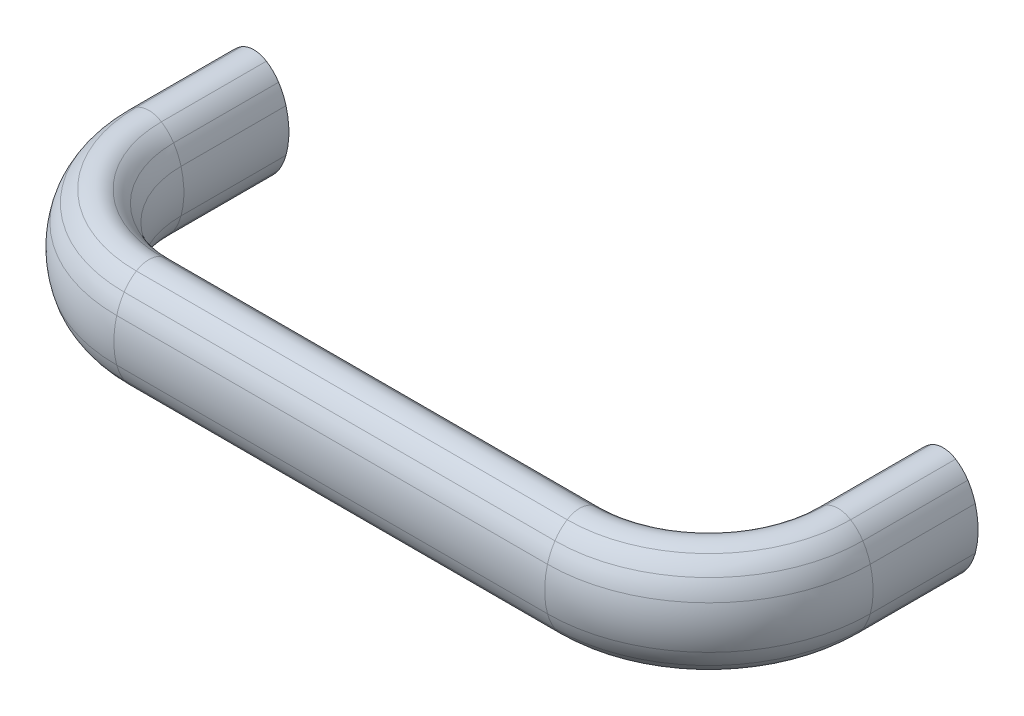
ISO-10303-21;
HEADER;
FILE_DESCRIPTION(('STEP AP214'),'2;1');
FILE_NAME('part.step','',(''),(''),'','','');
FILE_SCHEMA(('AUTOMOTIVE_DESIGN { 1 0 10303 214 1 1 1 1 }'));
ENDSEC;
DATA;
#1=APPLICATION_CONTEXT('core data for automotive mechanical design processes');
#2=APPLICATION_PROTOCOL_DEFINITION('international standard','automotive_design',2000,#1);
#3=PRODUCT_CONTEXT('',#1,'mechanical');
#4=PRODUCT('Part','Part','',(#3));
#5=PRODUCT_RELATED_PRODUCT_CATEGORY('part','',(#4));
#6=PRODUCT_DEFINITION_FORMATION('','',#4);
#7=PRODUCT_DEFINITION_CONTEXT('part definition',#1,'design');
#8=PRODUCT_DEFINITION('design','',#6,#7);
#9=PRODUCT_DEFINITION_SHAPE('','',#8);
#10=(LENGTH_UNIT() NAMED_UNIT(*) SI_UNIT(.MILLI.,.METRE.));
#11=(NAMED_UNIT(*) PLANE_ANGLE_UNIT() SI_UNIT($,.RADIAN.));
#12=(NAMED_UNIT(*) SI_UNIT($,.STERADIAN.) SOLID_ANGLE_UNIT());
#13=UNCERTAINTY_MEASURE_WITH_UNIT(LENGTH_MEASURE(1.E-05),#10,'distance_accuracy_value','');
#14=(GEOMETRIC_REPRESENTATION_CONTEXT(3) GLOBAL_UNCERTAINTY_ASSIGNED_CONTEXT((#13)) GLOBAL_UNIT_ASSIGNED_CONTEXT((#10,
#11,#12)) REPRESENTATION_CONTEXT('',''));
#15=CARTESIAN_POINT('',(0.,0.,0.));
#16=DIRECTION('',(0.,0.,1.));
#17=DIRECTION('',(1.,0.,0.));
#18=AXIS2_PLACEMENT_3D('',#15,#16,#17);
#19=CARTESIAN_POINT('',(126.266980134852,2.95863916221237,19.4999999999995));
#20=DIRECTION('',(0.,0.,-1.));
#21=DIRECTION('',(0.,1.,0.));
#22=AXIS2_PLACEMENT_3D('',#19,#20,#21);
#23=CYLINDRICAL_SURFACE('',#22,7.54594714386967);
#24=CARTESIAN_POINT('',(126.266980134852,2.95863916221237,19.4999999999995));
#25=DIRECTION('',(0.,0.,1.));
#26=DIRECTION('',(0.,1.,0.));
#27=AXIS2_PLACEMENT_3D('',#24,#25,#26);
#28=CIRCLE('',#27,7.54594714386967);
#29=CARTESIAN_POINT('',(132.593831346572,7.07109244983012,19.4999999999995));
#30=VERTEX_POINT('',#29);
#31=CARTESIAN_POINT('',(130.322235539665,9.32230335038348,19.4999999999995));
#32=VERTEX_POINT('',#31);
#33=EDGE_CURVE('E504',#30,#32,#28,.T.);
#34=ORIENTED_EDGE('',*,*,#33,.F.);
#35=DIRECTION('',(0.,0.,-1.));
#36=VECTOR('',#35,1.);
#37=CARTESIAN_POINT('',(132.593831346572,7.07109244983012,19.4999999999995));
#38=LINE('',#37,#36);
#39=CARTESIAN_POINT('',(132.593831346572,7.07109244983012,-1.94289029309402E-13));
#40=VERTEX_POINT('',#39);
#41=EDGE_CURVE('E22',#30,#40,#38,.T.);
#42=ORIENTED_EDGE('',*,*,#41,.T.);
#43=CARTESIAN_POINT('',(126.266980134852,2.95863916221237,-1.80411241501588E-13));
#44=DIRECTION('',(0.,0.,1.));
#45=DIRECTION('',(0.,1.,0.));
#46=AXIS2_PLACEMENT_3D('',#43,#44,#45);
#47=CIRCLE('',#46,7.54594714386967);
#48=CARTESIAN_POINT('',(130.322235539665,9.32230335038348,-1.94289029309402E-13));
#49=VERTEX_POINT('',#48);
#50=EDGE_CURVE('E17',#40,#49,#47,.T.);
#51=ORIENTED_EDGE('',*,*,#50,.T.);
#52=DIRECTION('',(0.,0.,-1.));
#53=VECTOR('',#52,1.);
#54=CARTESIAN_POINT('',(130.322235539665,9.32230335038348,19.4999999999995));
#55=LINE('',#54,#53);
#56=EDGE_CURVE('E9',#32,#49,#55,.T.);
#57=ORIENTED_EDGE('',*,*,#56,.F.);
#58=EDGE_LOOP('',(#34,#42,#51,#57));
#59=FACE_BOUND('',#58,.T.);
#60=ADVANCED_FACE('F14',(#59),#23,.T.);
#61=CARTESIAN_POINT('',(123.517667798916,1.17158614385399,19.4999999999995));
#62=DIRECTION('',(0.,0.,-1.));
#63=DIRECTION('',(0.,1.,0.));
#64=AXIS2_PLACEMENT_3D('',#61,#62,#63);
#65=CYLINDRICAL_SURFACE('',#64,10.8250135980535);
#66=CARTESIAN_POINT('',(123.517667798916,1.17158614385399,19.4999999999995));
#67=DIRECTION('',(0.,0.,1.));
#68=DIRECTION('',(0.,1.,0.));
#69=AXIS2_PLACEMENT_3D('',#66,#67,#68);
#70=CIRCLE('',#69,10.8250135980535);
#71=CARTESIAN_POINT('',(133.97045040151,3.98588095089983,19.4999999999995));
#72=VERTEX_POINT('',#71);
#73=EDGE_CURVE('E564',#72,#30,#70,.T.);
#74=ORIENTED_EDGE('',*,*,#73,.F.);
#75=DIRECTION('',(0.,0.,-1.));
#76=VECTOR('',#75,1.);
#77=CARTESIAN_POINT('',(133.97045040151,3.98588095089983,19.4999999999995));
#78=LINE('',#77,#76);
#79=CARTESIAN_POINT('',(133.97045040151,3.98588095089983,-1.94289029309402E-13));
#80=VERTEX_POINT('',#79);
#81=EDGE_CURVE('E596',#72,#80,#78,.T.);
#82=ORIENTED_EDGE('',*,*,#81,.T.);
#83=CARTESIAN_POINT('',(123.517667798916,1.17158614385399,-1.80411241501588E-13));
#84=DIRECTION('',(0.,0.,1.));
#85=DIRECTION('',(0.,1.,0.));
#86=AXIS2_PLACEMENT_3D('',#83,#84,#85);
#87=CIRCLE('',#86,10.8250135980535);
#88=EDGE_CURVE('E38',#80,#40,#87,.T.);
#89=ORIENTED_EDGE('',*,*,#88,.T.);
#90=ORIENTED_EDGE('',*,*,#41,.F.);
#91=EDGE_LOOP('',(#74,#82,#89,#90));
#92=FACE_BOUND('',#91,.T.);
#93=ADVANCED_FACE('F685',(#92),#65,.T.);
#94=CARTESIAN_POINT('',(119.166283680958,2.46379646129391E-05,19.4999999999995));
#95=DIRECTION('',(0.,0.,-1.));
#96=DIRECTION('',(0.,1.,0.));
#97=AXIS2_PLACEMENT_3D('',#94,#95,#96);
#98=CYLINDRICAL_SURFACE('',#97,15.331353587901);
#99=CARTESIAN_POINT('',(119.166283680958,2.46379646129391E-05,19.4999999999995));
#100=DIRECTION('',(0.,0.,1.));
#101=DIRECTION('',(0.,1.,0.));
#102=AXIS2_PLACEMENT_3D('',#99,#100,#101);
#103=CIRCLE('',#102,15.331353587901);
#104=CARTESIAN_POINT('',(133.97045040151,-3.98583167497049,19.4999999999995));
#105=VERTEX_POINT('',#104);
#106=EDGE_CURVE('E562',#105,#72,#103,.T.);
#107=ORIENTED_EDGE('',*,*,#106,.F.);
#108=DIRECTION('',(0.,0.,-1.));
#109=VECTOR('',#108,1.);
#110=CARTESIAN_POINT('',(133.97045040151,-3.98583167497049,19.4999999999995));
#111=LINE('',#110,#109);
#112=CARTESIAN_POINT('',(133.97045040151,-3.98583167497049,-1.94289029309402E-13));
#113=VERTEX_POINT('',#112);
#114=EDGE_CURVE('E593',#105,#113,#111,.T.);
#115=ORIENTED_EDGE('',*,*,#114,.T.);
#116=CARTESIAN_POINT('',(119.166283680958,2.46379646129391E-05,-1.80411241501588E-13));
#117=DIRECTION('',(0.,0.,1.));
#118=DIRECTION('',(0.,1.,0.));
#119=AXIS2_PLACEMENT_3D('',#116,#117,#118);
#120=CIRCLE('',#119,15.331353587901);
#121=EDGE_CURVE('E622',#113,#80,#120,.T.);
#122=ORIENTED_EDGE('',*,*,#121,.T.);
#123=ORIENTED_EDGE('',*,*,#81,.F.);
#124=EDGE_LOOP('',(#107,#115,#122,#123));
#125=FACE_BOUND('',#124,.T.);
#126=ADVANCED_FACE('F690',(#125),#98,.T.);
#127=CARTESIAN_POINT('',(123.517667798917,-1.1715368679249,19.4999999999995));
#128=DIRECTION('',(0.,0.,-1.));
#129=DIRECTION('',(0.,1.,0.));
#130=AXIS2_PLACEMENT_3D('',#127,#128,#129);
#131=CYLINDRICAL_SURFACE('',#130,10.8250135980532);
#132=CARTESIAN_POINT('',(123.517667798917,-1.1715368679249,19.4999999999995));
#133=DIRECTION('',(0.,0.,1.));
#134=DIRECTION('',(0.,1.,0.));
#135=AXIS2_PLACEMENT_3D('',#132,#133,#134);
#136=CIRCLE('',#135,10.8250135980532);
#137=CARTESIAN_POINT('',(132.593831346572,-7.07104317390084,19.4999999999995));
#138=VERTEX_POINT('',#137);
#139=EDGE_CURVE('E559',#138,#105,#136,.T.);
#140=ORIENTED_EDGE('',*,*,#139,.F.);
#141=DIRECTION('',(0.,0.,-1.));
#142=VECTOR('',#141,1.);
#143=CARTESIAN_POINT('',(132.593831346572,-7.07104317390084,19.4999999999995));
#144=LINE('',#143,#142);
#145=CARTESIAN_POINT('',(132.593831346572,-7.07104317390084,-1.94289029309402E-13));
#146=VERTEX_POINT('',#145);
#147=EDGE_CURVE('E590',#138,#146,#144,.T.);
#148=ORIENTED_EDGE('',*,*,#147,.T.);
#149=CARTESIAN_POINT('',(123.517667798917,-1.1715368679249,-1.80411241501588E-13));
#150=DIRECTION('',(0.,0.,1.));
#151=DIRECTION('',(0.,1.,0.));
#152=AXIS2_PLACEMENT_3D('',#149,#150,#151);
#153=CIRCLE('',#152,10.8250135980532);
#154=EDGE_CURVE('E620',#146,#113,#153,.T.);
#155=ORIENTED_EDGE('',*,*,#154,.T.);
#156=ORIENTED_EDGE('',*,*,#114,.F.);
#157=EDGE_LOOP('',(#140,#148,#155,#156));
#158=FACE_BOUND('',#157,.T.);
#159=ADVANCED_FACE('F695',(#158),#131,.T.);
#160=CARTESIAN_POINT('',(126.266980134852,-2.95858988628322,19.4999999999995));
#161=DIRECTION('',(0.,0.,-1.));
#162=DIRECTION('',(0.,1.,0.));
#163=AXIS2_PLACEMENT_3D('',#160,#161,#162);
#164=CYLINDRICAL_SURFACE('',#163,7.54594714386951);
#165=CARTESIAN_POINT('',(126.266980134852,-2.95858988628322,19.4999999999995));
#166=DIRECTION('',(0.,0.,1.));
#167=DIRECTION('',(0.,1.,0.));
#168=AXIS2_PLACEMENT_3D('',#165,#166,#167);
#169=CIRCLE('',#168,7.54594714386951);
#170=CARTESIAN_POINT('',(130.322235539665,-9.32225407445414,19.4999999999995));
#171=VERTEX_POINT('',#170);
#172=EDGE_CURVE('E556',#171,#138,#169,.T.);
#173=ORIENTED_EDGE('',*,*,#172,.F.);
#174=DIRECTION('',(0.,0.,-1.));
#175=VECTOR('',#174,1.);
#176=CARTESIAN_POINT('',(130.322235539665,-9.32225407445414,19.4999999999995));
#177=LINE('',#176,#175);
#178=CARTESIAN_POINT('',(130.322235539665,-9.32225407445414,-1.94289029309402E-13));
#179=VERTEX_POINT('',#178);
#180=EDGE_CURVE('E587',#171,#179,#177,.T.);
#181=ORIENTED_EDGE('',*,*,#180,.T.);
#182=CARTESIAN_POINT('',(126.266980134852,-2.95858988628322,-1.80411241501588E-13));
#183=DIRECTION('',(0.,0.,1.));
#184=DIRECTION('',(0.,1.,0.));
#185=AXIS2_PLACEMENT_3D('',#182,#183,#184);
#186=CIRCLE('',#185,7.54594714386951);
#187=EDGE_CURVE('E618',#179,#146,#186,.T.);
#188=ORIENTED_EDGE('',*,*,#187,.T.);
#189=ORIENTED_EDGE('',*,*,#147,.F.);
#190=EDGE_LOOP('',(#173,#181,#188,#189));
#191=FACE_BOUND('',#190,.T.);
#192=ADVANCED_FACE('F701',(#191),#164,.T.);
#193=CARTESIAN_POINT('',(127.997637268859,-5.67440423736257,19.4999999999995));
#194=DIRECTION('',(0.,0.,-1.));
#195=DIRECTION('',(0.,1.,0.));
#196=AXIS2_PLACEMENT_3D('',#193,#194,#195);
#197=CYLINDRICAL_SURFACE('',#196,4.3255711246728);
#198=CARTESIAN_POINT('',(127.997637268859,-5.67440423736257,19.4999999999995));
#199=DIRECTION('',(0.,0.,-1.));
#200=DIRECTION('',(0.,-1.,0.));
#201=AXIS2_PLACEMENT_3D('',#198,#199,#200);
#202=CIRCLE('',#201,4.3255711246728);
#203=CARTESIAN_POINT('',(125.673038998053,-9.32225407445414,19.4999999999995));
#204=VERTEX_POINT('',#203);
#205=EDGE_CURVE('E553',#171,#204,#202,.T.);
#206=ORIENTED_EDGE('',*,*,#205,.T.);
#207=DIRECTION('',(0.,0.,-1.));
#208=VECTOR('',#207,1.);
#209=CARTESIAN_POINT('',(125.673038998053,-9.32225407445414,19.4999999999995));
#210=LINE('',#209,#208);
#211=CARTESIAN_POINT('',(125.673038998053,-9.32225407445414,-1.80411241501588E-13));
#212=VERTEX_POINT('',#211);
#213=EDGE_CURVE('E584',#204,#212,#210,.T.);
#214=ORIENTED_EDGE('',*,*,#213,.T.);
#215=CARTESIAN_POINT('',(127.997637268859,-5.67440423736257,-1.80411241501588E-13));
#216=DIRECTION('',(0.,0.,-1.));
#217=DIRECTION('',(0.,-1.,0.));
#218=AXIS2_PLACEMENT_3D('',#215,#216,#217);
#219=CIRCLE('',#218,4.3255711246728);
#220=EDGE_CURVE('E615',#179,#212,#219,.T.);
#221=ORIENTED_EDGE('',*,*,#220,.F.);
#222=ORIENTED_EDGE('',*,*,#180,.F.);
#223=EDGE_LOOP('',(#206,#214,#221,#222));
#224=FACE_BOUND('',#223,.T.);
#225=ADVANCED_FACE('F705',(#224),#197,.T.);
#226=CARTESIAN_POINT('',(129.728294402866,-2.95858988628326,19.4999999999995));
#227=DIRECTION('',(0.,0.,-1.));
#228=DIRECTION('',(0.,1.,0.));
#229=AXIS2_PLACEMENT_3D('',#226,#227,#228);
#230=CYLINDRICAL_SURFACE('',#229,7.54594714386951);
#231=CARTESIAN_POINT('',(129.728294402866,-2.95858988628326,19.4999999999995));
#232=DIRECTION('',(0.,0.,-1.));
#233=DIRECTION('',(0.,-1.,0.));
#234=AXIS2_PLACEMENT_3D('',#231,#232,#233);
#235=CIRCLE('',#234,7.54594714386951);
#236=CARTESIAN_POINT('',(123.401443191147,-7.07104317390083,19.4999999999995));
#237=VERTEX_POINT('',#236);
#238=EDGE_CURVE('E550',#204,#237,#235,.T.);
#239=ORIENTED_EDGE('',*,*,#238,.T.);
#240=DIRECTION('',(0.,0.,-1.));
#241=VECTOR('',#240,1.);
#242=CARTESIAN_POINT('',(123.401443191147,-7.07104317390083,19.4999999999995));
#243=LINE('',#242,#241);
#244=CARTESIAN_POINT('',(123.401443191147,-7.07104317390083,-1.80411241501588E-13));
#245=VERTEX_POINT('',#244);
#246=EDGE_CURVE('E581',#237,#245,#243,.T.);
#247=ORIENTED_EDGE('',*,*,#246,.T.);
#248=CARTESIAN_POINT('',(129.728294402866,-2.95858988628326,-1.94289029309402E-13));
#249=DIRECTION('',(0.,0.,-1.));
#250=DIRECTION('',(0.,-1.,0.));
#251=AXIS2_PLACEMENT_3D('',#248,#249,#250);
#252=CIRCLE('',#251,7.54594714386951);
#253=EDGE_CURVE('E612',#212,#245,#252,.T.);
#254=ORIENTED_EDGE('',*,*,#253,.F.);
#255=ORIENTED_EDGE('',*,*,#213,.F.);
#256=EDGE_LOOP('',(#239,#247,#254,#255));
#257=FACE_BOUND('',#256,.T.);
#258=ADVANCED_FACE('F709',(#257),#230,.T.);
#259=CARTESIAN_POINT('',(132.477606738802,-1.17153686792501,19.4999999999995));
#260=DIRECTION('',(0.,0.,-1.));
#261=DIRECTION('',(0.,1.,0.));
#262=AXIS2_PLACEMENT_3D('',#259,#260,#261);
#263=CYLINDRICAL_SURFACE('',#262,10.8250135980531);
#264=CARTESIAN_POINT('',(132.477606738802,-1.17153686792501,19.4999999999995));
#265=DIRECTION('',(0.,0.,-1.));
#266=DIRECTION('',(0.,-1.,0.));
#267=AXIS2_PLACEMENT_3D('',#264,#265,#266);
#268=CIRCLE('',#267,10.8250135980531);
#269=CARTESIAN_POINT('',(122.024824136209,-3.98583167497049,19.4999999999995));
#270=VERTEX_POINT('',#269);
#271=EDGE_CURVE('E547',#237,#270,#268,.T.);
#272=ORIENTED_EDGE('',*,*,#271,.T.);
#273=DIRECTION('',(0.,0.,-1.));
#274=VECTOR('',#273,1.);
#275=CARTESIAN_POINT('',(122.024824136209,-3.98583167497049,19.4999999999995));
#276=LINE('',#275,#274);
#277=CARTESIAN_POINT('',(122.024824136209,-3.98583167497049,-1.80411241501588E-13));
#278=VERTEX_POINT('',#277);
#279=EDGE_CURVE('E578',#270,#278,#276,.T.);
#280=ORIENTED_EDGE('',*,*,#279,.T.);
#281=CARTESIAN_POINT('',(132.477606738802,-1.17153686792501,-1.94289029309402E-13));
#282=DIRECTION('',(0.,0.,-1.));
#283=DIRECTION('',(0.,-1.,0.));
#284=AXIS2_PLACEMENT_3D('',#281,#282,#283);
#285=CIRCLE('',#284,10.8250135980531);
#286=EDGE_CURVE('E609',#245,#278,#285,.T.);
#287=ORIENTED_EDGE('',*,*,#286,.F.);
#288=ORIENTED_EDGE('',*,*,#246,.F.);
#289=EDGE_LOOP('',(#272,#280,#287,#288));
#290=FACE_BOUND('',#289,.T.);
#291=ADVANCED_FACE('F713',(#290),#263,.T.);
#292=CARTESIAN_POINT('',(136.82899085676,2.46379646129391E-05,19.4999999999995));
#293=DIRECTION('',(0.,0.,-1.));
#294=DIRECTION('',(0.,1.,0.));
#295=AXIS2_PLACEMENT_3D('',#292,#293,#294);
#296=CYLINDRICAL_SURFACE('',#295,15.331353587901);
#297=CARTESIAN_POINT('',(136.82899085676,2.46379646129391E-05,19.4999999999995));
#298=DIRECTION('',(0.,0.,-1.));
#299=DIRECTION('',(0.,-1.,0.));
#300=AXIS2_PLACEMENT_3D('',#297,#298,#299);
#301=CIRCLE('',#300,15.331353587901);
#302=CARTESIAN_POINT('',(122.024824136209,3.98588095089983,19.4999999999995));
#303=VERTEX_POINT('',#302);
#304=EDGE_CURVE('E544',#270,#303,#301,.T.);
#305=ORIENTED_EDGE('',*,*,#304,.T.);
#306=DIRECTION('',(0.,0.,-1.));
#307=VECTOR('',#306,1.);
#308=CARTESIAN_POINT('',(122.024824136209,3.98588095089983,19.4999999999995));
#309=LINE('',#308,#307);
#310=CARTESIAN_POINT('',(122.024824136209,3.98588095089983,-1.80411241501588E-13));
#311=VERTEX_POINT('',#310);
#312=EDGE_CURVE('E575',#303,#311,#309,.T.);
#313=ORIENTED_EDGE('',*,*,#312,.T.);
#314=CARTESIAN_POINT('',(136.82899085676,2.46379646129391E-05,-1.94289029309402E-13));
#315=DIRECTION('',(0.,0.,-1.));
#316=DIRECTION('',(0.,-1.,0.));
#317=AXIS2_PLACEMENT_3D('',#314,#315,#316);
#318=CIRCLE('',#317,15.331353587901);
#319=EDGE_CURVE('E606',#278,#311,#318,.T.);
#320=ORIENTED_EDGE('',*,*,#319,.F.);
#321=ORIENTED_EDGE('',*,*,#279,.F.);
#322=EDGE_LOOP('',(#305,#313,#320,#321));
#323=FACE_BOUND('',#322,.T.);
#324=ADVANCED_FACE('F717',(#323),#296,.T.);
#325=CARTESIAN_POINT('',(132.477606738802,1.1715861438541,19.4999999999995));
#326=DIRECTION('',(0.,0.,-1.));
#327=DIRECTION('',(0.,1.,0.));
#328=AXIS2_PLACEMENT_3D('',#325,#326,#327);
#329=CYLINDRICAL_SURFACE('',#328,10.8250135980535);
#330=CARTESIAN_POINT('',(132.477606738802,1.1715861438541,19.4999999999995));
#331=DIRECTION('',(0.,0.,-1.));
#332=DIRECTION('',(0.,-1.,0.));
#333=AXIS2_PLACEMENT_3D('',#330,#331,#332);
#334=CIRCLE('',#333,10.8250135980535);
#335=CARTESIAN_POINT('',(123.401443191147,7.07109244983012,19.4999999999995));
#336=VERTEX_POINT('',#335);
#337=EDGE_CURVE('E541',#303,#336,#334,.T.);
#338=ORIENTED_EDGE('',*,*,#337,.T.);
#339=DIRECTION('',(0.,0.,-1.));
#340=VECTOR('',#339,1.);
#341=CARTESIAN_POINT('',(123.401443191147,7.07109244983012,19.4999999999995));
#342=LINE('',#341,#340);
#343=CARTESIAN_POINT('',(123.401443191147,7.07109244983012,-1.80411241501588E-13));
#344=VERTEX_POINT('',#343);
#345=EDGE_CURVE('E572',#336,#344,#342,.T.);
#346=ORIENTED_EDGE('',*,*,#345,.T.);
#347=CARTESIAN_POINT('',(132.477606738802,1.1715861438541,-1.94289029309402E-13));
#348=DIRECTION('',(0.,0.,-1.));
#349=DIRECTION('',(0.,-1.,0.));
#350=AXIS2_PLACEMENT_3D('',#347,#348,#349);
#351=CIRCLE('',#350,10.8250135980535);
#352=EDGE_CURVE('E603',#311,#344,#351,.T.);
#353=ORIENTED_EDGE('',*,*,#352,.F.);
#354=ORIENTED_EDGE('',*,*,#312,.F.);
#355=EDGE_LOOP('',(#338,#346,#353,#354));
#356=FACE_BOUND('',#355,.T.);
#357=ADVANCED_FACE('F721',(#356),#329,.T.);
#358=CARTESIAN_POINT('',(129.728294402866,2.95863916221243,19.4999999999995));
#359=DIRECTION('',(0.,0.,-1.));
#360=DIRECTION('',(0.,1.,0.));
#361=AXIS2_PLACEMENT_3D('',#358,#359,#360);
#362=CYLINDRICAL_SURFACE('',#361,7.54594714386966);
#363=CARTESIAN_POINT('',(129.728294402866,2.95863916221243,19.4999999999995));
#364=DIRECTION('',(0.,0.,-1.));
#365=DIRECTION('',(0.,-1.,0.));
#366=AXIS2_PLACEMENT_3D('',#363,#364,#365);
#367=CIRCLE('',#366,7.54594714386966);
#368=CARTESIAN_POINT('',(125.673038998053,9.32230335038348,19.4999999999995));
#369=VERTEX_POINT('',#368);
#370=EDGE_CURVE('E538',#336,#369,#367,.T.);
#371=ORIENTED_EDGE('',*,*,#370,.T.);
#372=DIRECTION('',(0.,0.,-1.));
#373=VECTOR('',#372,1.);
#374=CARTESIAN_POINT('',(125.673038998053,9.32230335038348,19.4999999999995));
#375=LINE('',#374,#373);
#376=CARTESIAN_POINT('',(125.673038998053,9.32230335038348,-1.80411241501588E-13));
#377=VERTEX_POINT('',#376);
#378=EDGE_CURVE('E569',#369,#377,#375,.T.);
#379=ORIENTED_EDGE('',*,*,#378,.T.);
#380=CARTESIAN_POINT('',(129.728294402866,2.95863916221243,-1.94289029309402E-13));
#381=DIRECTION('',(0.,0.,-1.));
#382=DIRECTION('',(0.,-1.,0.));
#383=AXIS2_PLACEMENT_3D('',#380,#381,#382);
#384=CIRCLE('',#383,7.54594714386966);
#385=EDGE_CURVE('E601',#344,#377,#384,.T.);
#386=ORIENTED_EDGE('',*,*,#385,.F.);
#387=ORIENTED_EDGE('',*,*,#345,.F.);
#388=EDGE_LOOP('',(#371,#379,#386,#387));
#389=FACE_BOUND('',#388,.T.);
#390=ADVANCED_FACE('F682',(#389),#362,.T.);
#391=CARTESIAN_POINT('',(127.997637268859,5.67445351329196,19.4999999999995));
#392=DIRECTION('',(0.,0.,-1.));
#393=DIRECTION('',(0.,1.,0.));
#394=AXIS2_PLACEMENT_3D('',#391,#392,#393);
#395=CYLINDRICAL_SURFACE('',#394,4.32557112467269);
#396=CARTESIAN_POINT('',(127.997637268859,5.67445351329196,19.4999999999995));
#397=DIRECTION('',(0.,0.,-1.));
#398=DIRECTION('',(0.,-1.,0.));
#399=AXIS2_PLACEMENT_3D('',#396,#397,#398);
#400=CIRCLE('',#399,4.32557112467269);
#401=EDGE_CURVE('E467',#369,#32,#400,.T.);
#402=ORIENTED_EDGE('',*,*,#401,.T.);
#403=ORIENTED_EDGE('',*,*,#56,.T.);
#404=CARTESIAN_POINT('',(127.997637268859,5.67445351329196,-1.80411241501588E-13));
#405=DIRECTION('',(0.,0.,-1.));
#406=DIRECTION('',(0.,-1.,0.));
#407=AXIS2_PLACEMENT_3D('',#404,#405,#406);
#408=CIRCLE('',#407,4.32557112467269);
#409=EDGE_CURVE('E30',#377,#49,#408,.T.);
#410=ORIENTED_EDGE('',*,*,#409,.F.);
#411=ORIENTED_EDGE('',*,*,#378,.F.);
#412=EDGE_LOOP('',(#402,#403,#410,#411));
#413=FACE_BOUND('',#412,.T.);
#414=ADVANCED_FACE('F627',(#413),#395,.T.);
#415=CARTESIAN_POINT('',(104.,2.95863916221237,19.4999999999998));
#416=DIRECTION('',(0.,1.,0.));
#417=DIRECTION('',(-1.,0.,0.));
#418=AXIS2_PLACEMENT_3D('',#415,#416,#417);
#419=TOROIDAL_SURFACE('',#418,22.2669801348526,7.54594714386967);
#420=CARTESIAN_POINT('',(104.,2.95863916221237,41.7669801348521));
#421=DIRECTION('',(-1.,0.,0.));
#422=DIRECTION('',(0.,1.,0.));
#423=AXIS2_PLACEMENT_3D('',#420,#421,#422);
#424=CIRCLE('',#423,7.54594714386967);
#425=CARTESIAN_POINT('',(104.,7.07109244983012,48.0938313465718));
#426=VERTEX_POINT('',#425);
#427=CARTESIAN_POINT('',(104.,9.32230335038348,45.8222355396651));
#428=VERTEX_POINT('',#427);
#429=EDGE_CURVE('E434',#426,#428,#424,.T.);
#430=ORIENTED_EDGE('',*,*,#429,.F.);
#431=CARTESIAN_POINT('',(104.,7.07109244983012,19.4999999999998));
#432=DIRECTION('',(0.,1.,0.));
#433=DIRECTION('',(-1.,0.,0.));
#434=AXIS2_PLACEMENT_3D('',#431,#432,#433);
#435=CIRCLE('',#434,28.5938313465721);
#436=EDGE_CURVE('E531',#426,#30,#435,.T.);
#437=ORIENTED_EDGE('',*,*,#436,.T.);
#438=ORIENTED_EDGE('',*,*,#33,.T.);
#439=CARTESIAN_POINT('',(104.,9.32230335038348,19.4999999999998));
#440=DIRECTION('',(0.,1.,0.));
#441=DIRECTION('',(-1.,0.,0.));
#442=AXIS2_PLACEMENT_3D('',#439,#440,#441);
#443=CIRCLE('',#442,26.3222355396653);
#444=EDGE_CURVE('E534',#428,#32,#443,.T.);
#445=ORIENTED_EDGE('',*,*,#444,.F.);
#446=EDGE_LOOP('',(#430,#437,#438,#445));
#447=FACE_BOUND('',#446,.T.);
#448=ADVANCED_FACE('F671',(#447),#419,.T.);
#449=CARTESIAN_POINT('',(104.,1.17158614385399,19.4999999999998));
#450=DIRECTION('',(0.,1.,0.));
#451=DIRECTION('',(-1.,0.,0.));
#452=AXIS2_PLACEMENT_3D('',#449,#450,#451);
#453=TOROIDAL_SURFACE('',#452,19.5176677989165,10.8250135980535);
#454=CARTESIAN_POINT('',(104.,1.17158614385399,39.0176677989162));
#455=DIRECTION('',(-1.,0.,0.));
#456=DIRECTION('',(0.,1.,0.));
#457=AXIS2_PLACEMENT_3D('',#454,#455,#456);
#458=CIRCLE('',#457,10.8250135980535);
#459=CARTESIAN_POINT('',(104.,3.98588095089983,49.4704504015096));
#460=VERTEX_POINT('',#459);
#461=EDGE_CURVE('E495',#460,#426,#458,.T.);
#462=ORIENTED_EDGE('',*,*,#461,.F.);
#463=CARTESIAN_POINT('',(104.,3.98588095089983,19.4999999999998));
#464=DIRECTION('',(0.,1.,0.));
#465=DIRECTION('',(-1.,0.,0.));
#466=AXIS2_PLACEMENT_3D('',#463,#464,#465);
#467=CIRCLE('',#466,29.9704504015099);
#468=EDGE_CURVE('E528',#460,#72,#467,.T.);
#469=ORIENTED_EDGE('',*,*,#468,.T.);
#470=ORIENTED_EDGE('',*,*,#73,.T.);
#471=ORIENTED_EDGE('',*,*,#436,.F.);
#472=EDGE_LOOP('',(#462,#469,#470,#471));
#473=FACE_BOUND('',#472,.T.);
#474=ADVANCED_FACE('F666',(#473),#453,.T.);
#475=CARTESIAN_POINT('',(104.,2.46379646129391E-05,19.4999999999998));
#476=DIRECTION('',(0.,1.,0.));
#477=DIRECTION('',(-1.,0.,0.));
#478=AXIS2_PLACEMENT_3D('',#475,#476,#477);
#479=DEGENERATE_TOROIDAL_SURFACE('',#478,15.1662836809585,15.331353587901,.T.);
#480=CARTESIAN_POINT('',(104.,2.46379646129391E-05,34.6662836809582));
#481=DIRECTION('',(-1.,0.,0.));
#482=DIRECTION('',(0.,1.,0.));
#483=AXIS2_PLACEMENT_3D('',#480,#481,#482);
#484=CIRCLE('',#483,15.331353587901);
#485=CARTESIAN_POINT('',(104.,-3.98583167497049,49.4704504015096));
#486=VERTEX_POINT('',#485);
#487=EDGE_CURVE('E493',#486,#460,#484,.T.);
#488=ORIENTED_EDGE('',*,*,#487,.F.);
#489=CARTESIAN_POINT('',(104.,-3.98583167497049,19.4999999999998));
#490=DIRECTION('',(0.,1.,0.));
#491=DIRECTION('',(-1.,0.,0.));
#492=AXIS2_PLACEMENT_3D('',#489,#490,#491);
#493=CIRCLE('',#492,29.9704504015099);
#494=EDGE_CURVE('E525',#486,#105,#493,.T.);
#495=ORIENTED_EDGE('',*,*,#494,.T.);
#496=ORIENTED_EDGE('',*,*,#106,.T.);
#497=ORIENTED_EDGE('',*,*,#468,.F.);
#498=EDGE_LOOP('',(#488,#495,#496,#497));
#499=FACE_BOUND('',#498,.T.);
#500=ADVANCED_FACE('F680',(#499),#479,.T.);
#501=CARTESIAN_POINT('',(104.,-1.1715368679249,19.4999999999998));
#502=DIRECTION('',(0.,1.,0.));
#503=DIRECTION('',(-1.,0.,0.));
#504=AXIS2_PLACEMENT_3D('',#501,#502,#503);
#505=TOROIDAL_SURFACE('',#504,19.5176677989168,10.8250135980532);
#506=CARTESIAN_POINT('',(104.,-1.1715368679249,39.0176677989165));
#507=DIRECTION('',(-1.,0.,0.));
#508=DIRECTION('',(0.,1.,0.));
#509=AXIS2_PLACEMENT_3D('',#506,#507,#508);
#510=CIRCLE('',#509,10.8250135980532);
#511=CARTESIAN_POINT('',(104.,-7.07104317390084,48.0938313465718));
#512=VERTEX_POINT('',#511);
#513=EDGE_CURVE('E490',#512,#486,#510,.T.);
#514=ORIENTED_EDGE('',*,*,#513,.F.);
#515=CARTESIAN_POINT('',(104.,-7.07104317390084,19.4999999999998));
#516=DIRECTION('',(0.,1.,0.));
#517=DIRECTION('',(-1.,0.,0.));
#518=AXIS2_PLACEMENT_3D('',#515,#516,#517);
#519=CIRCLE('',#518,28.5938313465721);
#520=EDGE_CURVE('E522',#512,#138,#519,.T.);
#521=ORIENTED_EDGE('',*,*,#520,.T.);
#522=ORIENTED_EDGE('',*,*,#139,.T.);
#523=ORIENTED_EDGE('',*,*,#494,.F.);
#524=EDGE_LOOP('',(#514,#521,#522,#523));
#525=FACE_BOUND('',#524,.T.);
#526=ADVANCED_FACE('F898',(#525),#505,.T.);
#527=CARTESIAN_POINT('',(104.,-2.95858988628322,19.4999999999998));
#528=DIRECTION('',(0.,1.,0.));
#529=DIRECTION('',(-1.,0.,0.));
#530=AXIS2_PLACEMENT_3D('',#527,#528,#529);
#531=TOROIDAL_SURFACE('',#530,22.2669801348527,7.54594714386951);
#532=CARTESIAN_POINT('',(104.,-2.95858988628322,41.7669801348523));
#533=DIRECTION('',(-1.,0.,0.));
#534=DIRECTION('',(0.,1.,0.));
#535=AXIS2_PLACEMENT_3D('',#532,#533,#534);
#536=CIRCLE('',#535,7.54594714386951);
#537=CARTESIAN_POINT('',(104.,-9.32225407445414,45.8222355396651));
#538=VERTEX_POINT('',#537);
#539=EDGE_CURVE('E487',#538,#512,#536,.T.);
#540=ORIENTED_EDGE('',*,*,#539,.F.);
#541=CARTESIAN_POINT('',(104.,-9.32225407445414,19.4999999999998));
#542=DIRECTION('',(0.,1.,0.));
#543=DIRECTION('',(-1.,0.,0.));
#544=AXIS2_PLACEMENT_3D('',#541,#542,#543);
#545=CIRCLE('',#544,26.3222355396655);
#546=EDGE_CURVE('E519',#538,#171,#545,.T.);
#547=ORIENTED_EDGE('',*,*,#546,.T.);
#548=ORIENTED_EDGE('',*,*,#172,.T.);
#549=ORIENTED_EDGE('',*,*,#520,.F.);
#550=EDGE_LOOP('',(#540,#547,#548,#549));
#551=FACE_BOUND('',#550,.T.);
#552=ADVANCED_FACE('F894',(#551),#531,.T.);
#553=CARTESIAN_POINT('',(104.,-5.67440423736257,19.4999999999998));
#554=DIRECTION('',(0.,1.,0.));
#555=DIRECTION('',(-1.,0.,0.));
#556=AXIS2_PLACEMENT_3D('',#553,#554,#555);
#557=TOROIDAL_SURFACE('',#556,23.9976372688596,4.3255711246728);
#558=CARTESIAN_POINT('',(104.,-5.67440423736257,43.4976372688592));
#559=DIRECTION('',(1.,0.,0.));
#560=DIRECTION('',(0.,-1.,0.));
#561=AXIS2_PLACEMENT_3D('',#558,#559,#560);
#562=CIRCLE('',#561,4.3255711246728);
#563=CARTESIAN_POINT('',(104.,-9.32225407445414,41.1730389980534));
#564=VERTEX_POINT('',#563);
#565=EDGE_CURVE('E484',#538,#564,#562,.T.);
#566=ORIENTED_EDGE('',*,*,#565,.T.);
#567=CARTESIAN_POINT('',(104.,-9.32225407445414,19.4999999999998));
#568=DIRECTION('',(0.,1.,0.));
#569=DIRECTION('',(-1.,0.,0.));
#570=AXIS2_PLACEMENT_3D('',#567,#568,#569);
#571=CIRCLE('',#570,21.6730389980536);
#572=EDGE_CURVE('E516',#564,#204,#571,.T.);
#573=ORIENTED_EDGE('',*,*,#572,.T.);
#574=ORIENTED_EDGE('',*,*,#205,.F.);
#575=ORIENTED_EDGE('',*,*,#546,.F.);
#576=EDGE_LOOP('',(#566,#573,#574,#575));
#577=FACE_BOUND('',#576,.T.);
#578=ADVANCED_FACE('F890',(#577),#557,.T.);
#579=CARTESIAN_POINT('',(104.,-2.95858988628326,19.4999999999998));
#580=DIRECTION('',(0.,1.,0.));
#581=DIRECTION('',(-1.,0.,0.));
#582=AXIS2_PLACEMENT_3D('',#579,#580,#581);
#583=TOROIDAL_SURFACE('',#582,25.7282944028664,7.54594714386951);
#584=CARTESIAN_POINT('',(104.,-2.95858988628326,45.2282944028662));
#585=DIRECTION('',(1.,0.,0.));
#586=DIRECTION('',(0.,-1.,0.));
#587=AXIS2_PLACEMENT_3D('',#584,#585,#586);
#588=CIRCLE('',#587,7.54594714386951);
#589=CARTESIAN_POINT('',(104.,-7.07104317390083,38.9014431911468));
#590=VERTEX_POINT('',#589);
#591=EDGE_CURVE('E481',#564,#590,#588,.T.);
#592=ORIENTED_EDGE('',*,*,#591,.T.);
#593=CARTESIAN_POINT('',(104.,-7.07104317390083,19.4999999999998));
#594=DIRECTION('',(0.,1.,0.));
#595=DIRECTION('',(-1.,0.,0.));
#596=AXIS2_PLACEMENT_3D('',#593,#594,#595);
#597=CIRCLE('',#596,19.401443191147);
#598=EDGE_CURVE('E513',#590,#237,#597,.T.);
#599=ORIENTED_EDGE('',*,*,#598,.T.);
#600=ORIENTED_EDGE('',*,*,#238,.F.);
#601=ORIENTED_EDGE('',*,*,#572,.F.);
#602=EDGE_LOOP('',(#592,#599,#600,#601));
#603=FACE_BOUND('',#602,.T.);
#604=ADVANCED_FACE('F886',(#603),#583,.T.);
#605=CARTESIAN_POINT('',(104.,-1.17153686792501,19.4999999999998));
#606=DIRECTION('',(0.,1.,0.));
#607=DIRECTION('',(-1.,0.,0.));
#608=AXIS2_PLACEMENT_3D('',#605,#606,#607);
#609=TOROIDAL_SURFACE('',#608,28.4776067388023,10.8250135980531);
#610=CARTESIAN_POINT('',(104.,-1.17153686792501,47.9776067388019));
#611=DIRECTION('',(1.,0.,0.));
#612=DIRECTION('',(0.,-1.,0.));
#613=AXIS2_PLACEMENT_3D('',#610,#611,#612);
#614=CIRCLE('',#613,10.8250135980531);
#615=CARTESIAN_POINT('',(104.,-3.98583167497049,37.5248241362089));
#616=VERTEX_POINT('',#615);
#617=EDGE_CURVE('E478',#590,#616,#614,.T.);
#618=ORIENTED_EDGE('',*,*,#617,.T.);
#619=CARTESIAN_POINT('',(104.,-3.98583167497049,19.4999999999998));
#620=DIRECTION('',(0.,1.,0.));
#621=DIRECTION('',(-1.,0.,0.));
#622=AXIS2_PLACEMENT_3D('',#619,#620,#621);
#623=CIRCLE('',#622,18.0248241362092);
#624=EDGE_CURVE('E510',#616,#270,#623,.T.);
#625=ORIENTED_EDGE('',*,*,#624,.T.);
#626=ORIENTED_EDGE('',*,*,#271,.F.);
#627=ORIENTED_EDGE('',*,*,#598,.F.);
#628=EDGE_LOOP('',(#618,#625,#626,#627));
#629=FACE_BOUND('',#628,.T.);
#630=ADVANCED_FACE('F883',(#629),#609,.T.);
#631=CARTESIAN_POINT('',(104.,2.46379646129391E-05,19.4999999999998));
#632=DIRECTION('',(0.,1.,0.));
#633=DIRECTION('',(-1.,0.,0.));
#634=AXIS2_PLACEMENT_3D('',#631,#632,#633);
#635=TOROIDAL_SURFACE('',#634,32.8289908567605,15.331353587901);
#636=CARTESIAN_POINT('',(104.,2.46379646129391E-05,52.3289908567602));
#637=DIRECTION('',(1.,0.,0.));
#638=DIRECTION('',(0.,-1.,0.));
#639=AXIS2_PLACEMENT_3D('',#636,#637,#638);
#640=CIRCLE('',#639,15.331353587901);
#641=CARTESIAN_POINT('',(104.,3.98588095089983,37.5248241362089));
#642=VERTEX_POINT('',#641);
#643=EDGE_CURVE('E475',#616,#642,#640,.T.);
#644=ORIENTED_EDGE('',*,*,#643,.T.);
#645=CARTESIAN_POINT('',(104.,3.98588095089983,19.4999999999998));
#646=DIRECTION('',(0.,1.,0.));
#647=DIRECTION('',(-1.,0.,0.));
#648=AXIS2_PLACEMENT_3D('',#645,#646,#647);
#649=CIRCLE('',#648,18.0248241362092);
#650=EDGE_CURVE('E507',#642,#303,#649,.T.);
#651=ORIENTED_EDGE('',*,*,#650,.T.);
#652=ORIENTED_EDGE('',*,*,#304,.F.);
#653=ORIENTED_EDGE('',*,*,#624,.F.);
#654=EDGE_LOOP('',(#644,#651,#652,#653));
#655=FACE_BOUND('',#654,.T.);
#656=ADVANCED_FACE('F735',(#655),#635,.T.);
#657=CARTESIAN_POINT('',(104.,1.1715861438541,19.4999999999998));
#658=DIRECTION('',(0.,1.,0.));
#659=DIRECTION('',(-1.,0.,0.));
#660=AXIS2_PLACEMENT_3D('',#657,#658,#659);
#661=TOROIDAL_SURFACE('',#660,28.4776067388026,10.8250135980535);
#662=CARTESIAN_POINT('',(104.,1.1715861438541,47.9776067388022));
#663=DIRECTION('',(1.,0.,0.));
#664=DIRECTION('',(0.,-1.,0.));
#665=AXIS2_PLACEMENT_3D('',#662,#663,#664);
#666=CIRCLE('',#665,10.8250135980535);
#667=CARTESIAN_POINT('',(104.,7.07109244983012,38.9014431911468));
#668=VERTEX_POINT('',#667);
#669=EDGE_CURVE('E472',#642,#668,#666,.T.);
#670=ORIENTED_EDGE('',*,*,#669,.T.);
#671=CARTESIAN_POINT('',(104.,7.07109244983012,19.4999999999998));
#672=DIRECTION('',(0.,1.,0.));
#673=DIRECTION('',(-1.,0.,0.));
#674=AXIS2_PLACEMENT_3D('',#671,#672,#673);
#675=CIRCLE('',#674,19.401443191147);
#676=EDGE_CURVE('E503',#668,#336,#675,.T.);
#677=ORIENTED_EDGE('',*,*,#676,.T.);
#678=ORIENTED_EDGE('',*,*,#337,.F.);
#679=ORIENTED_EDGE('',*,*,#650,.F.);
#680=EDGE_LOOP('',(#670,#677,#678,#679));
#681=FACE_BOUND('',#680,.T.);
#682=ADVANCED_FACE('F733',(#681),#661,.T.);
#683=CARTESIAN_POINT('',(104.,2.95863916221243,19.4999999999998));
#684=DIRECTION('',(0.,1.,0.));
#685=DIRECTION('',(-1.,0.,0.));
#686=AXIS2_PLACEMENT_3D('',#683,#684,#685);
#687=TOROIDAL_SURFACE('',#686,25.7282944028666,7.54594714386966);
#688=CARTESIAN_POINT('',(104.,2.95863916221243,45.2282944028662));
#689=DIRECTION('',(1.,0.,0.));
#690=DIRECTION('',(0.,-1.,0.));
#691=AXIS2_PLACEMENT_3D('',#688,#689,#690);
#692=CIRCLE('',#691,7.54594714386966);
#693=CARTESIAN_POINT('',(104.,9.32230335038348,41.1730389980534));
#694=VERTEX_POINT('',#693);
#695=EDGE_CURVE('E469',#668,#694,#692,.T.);
#696=ORIENTED_EDGE('',*,*,#695,.T.);
#697=CARTESIAN_POINT('',(104.,9.32230335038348,19.4999999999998));
#698=DIRECTION('',(0.,1.,0.));
#699=DIRECTION('',(-1.,0.,0.));
#700=AXIS2_PLACEMENT_3D('',#697,#698,#699);
#701=CIRCLE('',#700,21.6730389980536);
#702=EDGE_CURVE('E500',#694,#369,#701,.T.);
#703=ORIENTED_EDGE('',*,*,#702,.T.);
#704=ORIENTED_EDGE('',*,*,#370,.F.);
#705=ORIENTED_EDGE('',*,*,#676,.F.);
#706=EDGE_LOOP('',(#696,#703,#704,#705));
#707=FACE_BOUND('',#706,.T.);
#708=ADVANCED_FACE('F634',(#707),#687,.T.);
#709=CARTESIAN_POINT('',(104.,5.67445351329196,19.4999999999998));
#710=DIRECTION('',(0.,1.,0.));
#711=DIRECTION('',(-1.,0.,0.));
#712=AXIS2_PLACEMENT_3D('',#709,#710,#711);
#713=TOROIDAL_SURFACE('',#712,23.9976372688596,4.32557112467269);
#714=CARTESIAN_POINT('',(104.,5.67445351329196,43.4976372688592));
#715=DIRECTION('',(1.,0.,0.));
#716=DIRECTION('',(0.,-1.,0.));
#717=AXIS2_PLACEMENT_3D('',#714,#715,#716);
#718=CIRCLE('',#717,4.32557112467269);
#719=EDGE_CURVE('E397',#694,#428,#718,.T.);
#720=ORIENTED_EDGE('',*,*,#719,.T.);
#721=ORIENTED_EDGE('',*,*,#444,.T.);
#722=ORIENTED_EDGE('',*,*,#401,.F.);
#723=ORIENTED_EDGE('',*,*,#702,.F.);
#724=EDGE_LOOP('',(#720,#721,#722,#723));
#725=FACE_BOUND('',#724,.T.);
#726=ADVANCED_FACE('F630',(#725),#713,.T.);
#727=CARTESIAN_POINT('',(24.,2.95863916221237,41.7669801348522));
#728=DIRECTION('',(1.,0.,0.));
#729=DIRECTION('',(0.,1.,0.));
#730=AXIS2_PLACEMENT_3D('',#727,#728,#729);
#731=CYLINDRICAL_SURFACE('',#730,7.54594714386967);
#732=CARTESIAN_POINT('',(24.,2.95863916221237,41.7669801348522));
#733=DIRECTION('',(-1.,0.,0.));
#734=DIRECTION('',(0.,1.,0.));
#735=AXIS2_PLACEMENT_3D('',#732,#733,#734);
#736=CIRCLE('',#735,7.54594714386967);
#737=CARTESIAN_POINT('',(24.,7.07109244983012,48.0938313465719));
#738=VERTEX_POINT('',#737);
#739=CARTESIAN_POINT('',(24.,9.32230335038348,45.8222355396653));
#740=VERTEX_POINT('',#739);
#741=EDGE_CURVE('E364',#738,#740,#736,.T.);
#742=ORIENTED_EDGE('',*,*,#741,.F.);
#743=DIRECTION('',(1.,0.,0.));
#744=VECTOR('',#743,1.);
#745=CARTESIAN_POINT('',(24.,7.07109244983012,48.0938313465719));
#746=LINE('',#745,#744);
#747=EDGE_CURVE('E461',#738,#426,#746,.T.);
#748=ORIENTED_EDGE('',*,*,#747,.T.);
#749=ORIENTED_EDGE('',*,*,#429,.T.);
#750=DIRECTION('',(1.,0.,0.));
#751=VECTOR('',#750,1.);
#752=CARTESIAN_POINT('',(24.,9.32230335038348,45.8222355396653));
#753=LINE('',#752,#751);
#754=EDGE_CURVE('E464',#740,#428,#753,.T.);
#755=ORIENTED_EDGE('',*,*,#754,.F.);
#756=EDGE_LOOP('',(#742,#748,#749,#755));
#757=FACE_BOUND('',#756,.T.);
#758=ADVANCED_FACE('F656',(#757),#731,.T.);
#759=CARTESIAN_POINT('',(24.,1.17158614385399,39.0176677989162));
#760=DIRECTION('',(1.,0.,0.));
#761=DIRECTION('',(0.,1.,0.));
#762=AXIS2_PLACEMENT_3D('',#759,#760,#761);
#763=CYLINDRICAL_SURFACE('',#762,10.8250135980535);
#764=CARTESIAN_POINT('',(24.,1.17158614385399,39.0176677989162));
#765=DIRECTION('',(-1.,0.,0.));
#766=DIRECTION('',(0.,1.,0.));
#767=AXIS2_PLACEMENT_3D('',#764,#765,#766);
#768=CIRCLE('',#767,10.8250135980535);
#769=CARTESIAN_POINT('',(24.,3.98588095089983,49.4704504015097));
#770=VERTEX_POINT('',#769);
#771=EDGE_CURVE('E425',#770,#738,#768,.T.);
#772=ORIENTED_EDGE('',*,*,#771,.F.);
#773=DIRECTION('',(1.,0.,0.));
#774=VECTOR('',#773,1.);
#775=CARTESIAN_POINT('',(24.,3.98588095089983,49.4704504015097));
#776=LINE('',#775,#774);
#777=EDGE_CURVE('E458',#770,#460,#776,.T.);
#778=ORIENTED_EDGE('',*,*,#777,.T.);
#779=ORIENTED_EDGE('',*,*,#461,.T.);
#780=ORIENTED_EDGE('',*,*,#747,.F.);
#781=EDGE_LOOP('',(#772,#778,#779,#780));
#782=FACE_BOUND('',#781,.T.);
#783=ADVANCED_FACE('F662',(#782),#763,.T.);
#784=CARTESIAN_POINT('',(24.,2.46379646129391E-05,34.6662836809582));
#785=DIRECTION('',(1.,0.,0.));
#786=DIRECTION('',(0.,1.,0.));
#787=AXIS2_PLACEMENT_3D('',#784,#785,#786);
#788=CYLINDRICAL_SURFACE('',#787,15.331353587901);
#789=CARTESIAN_POINT('',(24.,2.46379646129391E-05,34.6662836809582));
#790=DIRECTION('',(-1.,0.,0.));
#791=DIRECTION('',(0.,1.,0.));
#792=AXIS2_PLACEMENT_3D('',#789,#790,#791);
#793=CIRCLE('',#792,15.331353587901);
#794=CARTESIAN_POINT('',(24.,-3.98583167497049,49.4704504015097));
#795=VERTEX_POINT('',#794);
#796=EDGE_CURVE('E423',#795,#770,#793,.T.);
#797=ORIENTED_EDGE('',*,*,#796,.F.);
#798=DIRECTION('',(1.,0.,0.));
#799=VECTOR('',#798,1.);
#800=CARTESIAN_POINT('',(24.,-3.98583167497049,49.4704504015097));
#801=LINE('',#800,#799);
#802=EDGE_CURVE('E455',#795,#486,#801,.T.);
#803=ORIENTED_EDGE('',*,*,#802,.T.);
#804=ORIENTED_EDGE('',*,*,#487,.T.);
#805=ORIENTED_EDGE('',*,*,#777,.F.);
#806=EDGE_LOOP('',(#797,#803,#804,#805));
#807=FACE_BOUND('',#806,.T.);
#808=ADVANCED_FACE('F866',(#807),#788,.T.);
#809=CARTESIAN_POINT('',(24.,-1.1715368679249,39.0176677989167));
#810=DIRECTION('',(1.,0.,0.));
#811=DIRECTION('',(0.,1.,0.));
#812=AXIS2_PLACEMENT_3D('',#809,#810,#811);
#813=CYLINDRICAL_SURFACE('',#812,10.8250135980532);
#814=CARTESIAN_POINT('',(24.,-1.1715368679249,39.0176677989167));
#815=DIRECTION('',(-1.,0.,0.));
#816=DIRECTION('',(0.,1.,0.));
#817=AXIS2_PLACEMENT_3D('',#814,#815,#816);
#818=CIRCLE('',#817,10.8250135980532);
#819=CARTESIAN_POINT('',(24.,-7.07104317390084,48.0938313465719));
#820=VERTEX_POINT('',#819);
#821=EDGE_CURVE('E420',#820,#795,#818,.T.);
#822=ORIENTED_EDGE('',*,*,#821,.F.);
#823=DIRECTION('',(1.,0.,0.));
#824=VECTOR('',#823,1.);
#825=CARTESIAN_POINT('',(24.,-7.07104317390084,48.0938313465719));
#826=LINE('',#825,#824);
#827=EDGE_CURVE('E452',#820,#512,#826,.T.);
#828=ORIENTED_EDGE('',*,*,#827,.T.);
#829=ORIENTED_EDGE('',*,*,#513,.T.);
#830=ORIENTED_EDGE('',*,*,#802,.F.);
#831=EDGE_LOOP('',(#822,#828,#829,#830));
#832=FACE_BOUND('',#831,.T.);
#833=ADVANCED_FACE('F862',(#832),#813,.T.);
#834=CARTESIAN_POINT('',(24.,-2.95858988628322,41.7669801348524));
#835=DIRECTION('',(1.,0.,0.));
#836=DIRECTION('',(0.,1.,0.));
#837=AXIS2_PLACEMENT_3D('',#834,#835,#836);
#838=CYLINDRICAL_SURFACE('',#837,7.54594714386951);
#839=CARTESIAN_POINT('',(24.,-2.95858988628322,41.7669801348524));
#840=DIRECTION('',(-1.,0.,0.));
#841=DIRECTION('',(0.,1.,0.));
#842=AXIS2_PLACEMENT_3D('',#839,#840,#841);
#843=CIRCLE('',#842,7.54594714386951);
#844=CARTESIAN_POINT('',(24.,-9.32225407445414,45.8222355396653));
#845=VERTEX_POINT('',#844);
#846=EDGE_CURVE('E417',#845,#820,#843,.T.);
#847=ORIENTED_EDGE('',*,*,#846,.F.);
#848=DIRECTION('',(1.,0.,0.));
#849=VECTOR('',#848,1.);
#850=CARTESIAN_POINT('',(24.,-9.32225407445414,45.8222355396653));
#851=LINE('',#850,#849);
#852=EDGE_CURVE('E449',#845,#538,#851,.T.);
#853=ORIENTED_EDGE('',*,*,#852,.T.);
#854=ORIENTED_EDGE('',*,*,#539,.T.);
#855=ORIENTED_EDGE('',*,*,#827,.F.);
#856=EDGE_LOOP('',(#847,#853,#854,#855));
#857=FACE_BOUND('',#856,.T.);
#858=ADVANCED_FACE('F858',(#857),#838,.T.);
#859=CARTESIAN_POINT('',(24.,-5.67440423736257,43.4976372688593));
#860=DIRECTION('',(1.,0.,0.));
#861=DIRECTION('',(0.,1.,0.));
#862=AXIS2_PLACEMENT_3D('',#859,#860,#861);
#863=CYLINDRICAL_SURFACE('',#862,4.3255711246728);
#864=CARTESIAN_POINT('',(24.,-5.67440423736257,43.4976372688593));
#865=DIRECTION('',(1.,0.,0.));
#866=DIRECTION('',(0.,-1.,0.));
#867=AXIS2_PLACEMENT_3D('',#864,#865,#866);
#868=CIRCLE('',#867,4.3255711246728);
#869=CARTESIAN_POINT('',(24.,-9.32225407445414,41.1730389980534));
#870=VERTEX_POINT('',#869);
#871=EDGE_CURVE('E414',#845,#870,#868,.T.);
#872=ORIENTED_EDGE('',*,*,#871,.T.);
#873=DIRECTION('',(1.,0.,0.));
#874=VECTOR('',#873,1.);
#875=CARTESIAN_POINT('',(24.,-9.32225407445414,41.1730389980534));
#876=LINE('',#875,#874);
#877=EDGE_CURVE('E446',#870,#564,#876,.T.);
#878=ORIENTED_EDGE('',*,*,#877,.T.);
#879=ORIENTED_EDGE('',*,*,#565,.F.);
#880=ORIENTED_EDGE('',*,*,#852,.F.);
#881=EDGE_LOOP('',(#872,#878,#879,#880));
#882=FACE_BOUND('',#881,.T.);
#883=ADVANCED_FACE('F854',(#882),#863,.T.);
#884=CARTESIAN_POINT('',(24.,-2.95858988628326,45.2282944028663));
#885=DIRECTION('',(1.,0.,0.));
#886=DIRECTION('',(0.,1.,0.));
#887=AXIS2_PLACEMENT_3D('',#884,#885,#886);
#888=CYLINDRICAL_SURFACE('',#887,7.54594714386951);
#889=CARTESIAN_POINT('',(24.,-2.95858988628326,45.2282944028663));
#890=DIRECTION('',(1.,0.,0.));
#891=DIRECTION('',(0.,-1.,0.));
#892=AXIS2_PLACEMENT_3D('',#889,#890,#891);
#893=CIRCLE('',#892,7.54594714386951);
#894=CARTESIAN_POINT('',(24.,-7.07104317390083,38.9014431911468));
#895=VERTEX_POINT('',#894);
#896=EDGE_CURVE('E411',#870,#895,#893,.T.);
#897=ORIENTED_EDGE('',*,*,#896,.T.);
#898=DIRECTION('',(1.,0.,0.));
#899=VECTOR('',#898,1.);
#900=CARTESIAN_POINT('',(24.,-7.07104317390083,38.9014431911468));
#901=LINE('',#900,#899);
#902=EDGE_CURVE('E443',#895,#590,#901,.T.);
#903=ORIENTED_EDGE('',*,*,#902,.T.);
#904=ORIENTED_EDGE('',*,*,#591,.F.);
#905=ORIENTED_EDGE('',*,*,#877,.F.);
#906=EDGE_LOOP('',(#897,#903,#904,#905));
#907=FACE_BOUND('',#906,.T.);
#908=ADVANCED_FACE('F850',(#907),#888,.T.);
#909=CARTESIAN_POINT('',(24.,-1.17153686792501,47.9776067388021));
#910=DIRECTION('',(1.,0.,0.));
#911=DIRECTION('',(0.,1.,0.));
#912=AXIS2_PLACEMENT_3D('',#909,#910,#911);
#913=CYLINDRICAL_SURFACE('',#912,10.8250135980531);
#914=CARTESIAN_POINT('',(24.,-1.17153686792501,47.9776067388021));
#915=DIRECTION('',(1.,0.,0.));
#916=DIRECTION('',(0.,-1.,0.));
#917=AXIS2_PLACEMENT_3D('',#914,#915,#916);
#918=CIRCLE('',#917,10.8250135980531);
#919=CARTESIAN_POINT('',(24.,-3.98583167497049,37.524824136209));
#920=VERTEX_POINT('',#919);
#921=EDGE_CURVE('E408',#895,#920,#918,.T.);
#922=ORIENTED_EDGE('',*,*,#921,.T.);
#923=DIRECTION('',(1.,0.,0.));
#924=VECTOR('',#923,1.);
#925=CARTESIAN_POINT('',(24.,-3.98583167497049,37.524824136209));
#926=LINE('',#925,#924);
#927=EDGE_CURVE('E440',#920,#616,#926,.T.);
#928=ORIENTED_EDGE('',*,*,#927,.T.);
#929=ORIENTED_EDGE('',*,*,#617,.F.);
#930=ORIENTED_EDGE('',*,*,#902,.F.);
#931=EDGE_LOOP('',(#922,#928,#929,#930));
#932=FACE_BOUND('',#931,.T.);
#933=ADVANCED_FACE('F847',(#932),#913,.T.);
#934=CARTESIAN_POINT('',(24.,2.46379646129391E-05,52.3289908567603));
#935=DIRECTION('',(1.,0.,0.));
#936=DIRECTION('',(0.,1.,0.));
#937=AXIS2_PLACEMENT_3D('',#934,#935,#936);
#938=CYLINDRICAL_SURFACE('',#937,15.331353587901);
#939=CARTESIAN_POINT('',(24.,2.46379646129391E-05,52.3289908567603));
#940=DIRECTION('',(1.,0.,0.));
#941=DIRECTION('',(0.,-1.,0.));
#942=AXIS2_PLACEMENT_3D('',#939,#940,#941);
#943=CIRCLE('',#942,15.331353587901);
#944=CARTESIAN_POINT('',(24.,3.98588095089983,37.524824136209));
#945=VERTEX_POINT('',#944);
#946=EDGE_CURVE('E405',#920,#945,#943,.T.);
#947=ORIENTED_EDGE('',*,*,#946,.T.);
#948=DIRECTION('',(1.,0.,0.));
#949=VECTOR('',#948,1.);
#950=CARTESIAN_POINT('',(24.,3.98588095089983,37.524824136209));
#951=LINE('',#950,#949);
#952=EDGE_CURVE('E437',#945,#642,#951,.T.);
#953=ORIENTED_EDGE('',*,*,#952,.T.);
#954=ORIENTED_EDGE('',*,*,#643,.F.);
#955=ORIENTED_EDGE('',*,*,#927,.F.);
#956=EDGE_LOOP('',(#947,#953,#954,#955));
#957=FACE_BOUND('',#956,.T.);
#958=ADVANCED_FACE('F743',(#957),#938,.T.);
#959=CARTESIAN_POINT('',(24.,1.1715861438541,47.9776067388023));
#960=DIRECTION('',(1.,0.,0.));
#961=DIRECTION('',(0.,1.,0.));
#962=AXIS2_PLACEMENT_3D('',#959,#960,#961);
#963=CYLINDRICAL_SURFACE('',#962,10.8250135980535);
#964=CARTESIAN_POINT('',(24.,1.1715861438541,47.9776067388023));
#965=DIRECTION('',(1.,0.,0.));
#966=DIRECTION('',(0.,-1.,0.));
#967=AXIS2_PLACEMENT_3D('',#964,#965,#966);
#968=CIRCLE('',#967,10.8250135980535);
#969=CARTESIAN_POINT('',(24.,7.07109244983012,38.9014431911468));
#970=VERTEX_POINT('',#969);
#971=EDGE_CURVE('E402',#945,#970,#968,.T.);
#972=ORIENTED_EDGE('',*,*,#971,.T.);
#973=DIRECTION('',(1.,0.,0.));
#974=VECTOR('',#973,1.);
#975=CARTESIAN_POINT('',(24.,7.07109244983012,38.9014431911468));
#976=LINE('',#975,#974);
#977=EDGE_CURVE('E433',#970,#668,#976,.T.);
#978=ORIENTED_EDGE('',*,*,#977,.T.);
#979=ORIENTED_EDGE('',*,*,#669,.F.);
#980=ORIENTED_EDGE('',*,*,#952,.F.);
#981=EDGE_LOOP('',(#972,#978,#979,#980));
#982=FACE_BOUND('',#981,.T.);
#983=ADVANCED_FACE('F742',(#982),#963,.T.);
#984=CARTESIAN_POINT('',(24.,2.95863916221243,45.2282944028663));
#985=DIRECTION('',(1.,0.,0.));
#986=DIRECTION('',(0.,1.,0.));
#987=AXIS2_PLACEMENT_3D('',#984,#985,#986);
#988=CYLINDRICAL_SURFACE('',#987,7.54594714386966);
#989=CARTESIAN_POINT('',(24.,2.95863916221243,45.2282944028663));
#990=DIRECTION('',(1.,0.,0.));
#991=DIRECTION('',(0.,-1.,0.));
#992=AXIS2_PLACEMENT_3D('',#989,#990,#991);
#993=CIRCLE('',#992,7.54594714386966);
#994=CARTESIAN_POINT('',(24.,9.32230335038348,41.1730389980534));
#995=VERTEX_POINT('',#994);
#996=EDGE_CURVE('E399',#970,#995,#993,.T.);
#997=ORIENTED_EDGE('',*,*,#996,.T.);
#998=DIRECTION('',(1.,0.,0.));
#999=VECTOR('',#998,1.);
#1000=CARTESIAN_POINT('',(24.,9.32230335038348,41.1730389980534));
#1001=LINE('',#1000,#999);
#1002=EDGE_CURVE('E430',#995,#694,#1001,.T.);
#1003=ORIENTED_EDGE('',*,*,#1002,.T.);
#1004=ORIENTED_EDGE('',*,*,#695,.F.);
#1005=ORIENTED_EDGE('',*,*,#977,.F.);
#1006=EDGE_LOOP('',(#997,#1003,#1004,#1005));
#1007=FACE_BOUND('',#1006,.T.);
#1008=ADVANCED_FACE('F641',(#1007),#988,.T.);
#1009=CARTESIAN_POINT('',(24.,5.67445351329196,43.4976372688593));
#1010=DIRECTION('',(1.,0.,0.));
#1011=DIRECTION('',(0.,1.,0.));
#1012=AXIS2_PLACEMENT_3D('',#1009,#1010,#1011);
#1013=CYLINDRICAL_SURFACE('',#1012,4.32557112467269);
#1014=CARTESIAN_POINT('',(24.,5.67445351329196,43.4976372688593));
#1015=DIRECTION('',(1.,0.,0.));
#1016=DIRECTION('',(0.,-1.,0.));
#1017=AXIS2_PLACEMENT_3D('',#1014,#1015,#1016);
#1018=CIRCLE('',#1017,4.32557112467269);
#1019=EDGE_CURVE('E271',#995,#740,#1018,.T.);
#1020=ORIENTED_EDGE('',*,*,#1019,.T.);
#1021=ORIENTED_EDGE('',*,*,#754,.T.);
#1022=ORIENTED_EDGE('',*,*,#719,.F.);
#1023=ORIENTED_EDGE('',*,*,#1002,.F.);
#1024=EDGE_LOOP('',(#1020,#1021,#1022,#1023));
#1025=FACE_BOUND('',#1024,.T.);
#1026=ADVANCED_FACE('F639',(#1025),#1013,.T.);
#1027=CARTESIAN_POINT('',(24.,2.95863916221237,19.5));
#1028=DIRECTION('',(0.,1.,0.));
#1029=DIRECTION('',(-1.,0.,0.));
#1030=AXIS2_PLACEMENT_3D('',#1027,#1028,#1029);
#1031=TOROIDAL_SURFACE('',#1030,22.2669801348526,7.54594714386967);
#1032=CARTESIAN_POINT('',(1.73301986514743,2.95863916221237,19.5));
#1033=DIRECTION('',(0.,0.,-1.));
#1034=DIRECTION('',(0.,1.,0.));
#1035=AXIS2_PLACEMENT_3D('',#1032,#1033,#1034);
#1036=CIRCLE('',#1035,7.54594714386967);
#1037=CARTESIAN_POINT('',(-4.59383134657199,7.07109244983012,19.5));
#1038=VERTEX_POINT('',#1037);
#1039=CARTESIAN_POINT('',(-2.3222355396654,9.32230335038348,19.5));
#1040=VERTEX_POINT('',#1039);
#1041=EDGE_CURVE('E270',#1038,#1040,#1036,.T.);
#1042=ORIENTED_EDGE('',*,*,#1041,.F.);
#1043=CARTESIAN_POINT('',(24.,7.07109244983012,19.5));
#1044=DIRECTION('',(0.,1.,0.));
#1045=DIRECTION('',(-1.,0.,0.));
#1046=AXIS2_PLACEMENT_3D('',#1043,#1044,#1045);
#1047=CIRCLE('',#1046,28.593831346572);
#1048=EDGE_CURVE('E391',#1038,#738,#1047,.T.);
#1049=ORIENTED_EDGE('',*,*,#1048,.T.);
#1050=ORIENTED_EDGE('',*,*,#741,.T.);
#1051=CARTESIAN_POINT('',(24.,9.32230335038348,19.5));
#1052=DIRECTION('',(0.,1.,0.));
#1053=DIRECTION('',(-1.,0.,0.));
#1054=AXIS2_PLACEMENT_3D('',#1051,#1052,#1053);
#1055=CIRCLE('',#1054,26.3222355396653);
#1056=EDGE_CURVE('E394',#1040,#740,#1055,.T.);
#1057=ORIENTED_EDGE('',*,*,#1056,.F.);
#1058=EDGE_LOOP('',(#1042,#1049,#1050,#1057));
#1059=FACE_BOUND('',#1058,.T.);
#1060=ADVANCED_FACE('F653',(#1059),#1031,.T.);
#1061=CARTESIAN_POINT('',(24.,1.17158614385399,19.5));
#1062=DIRECTION('',(0.,1.,0.));
#1063=DIRECTION('',(-1.,0.,0.));
#1064=AXIS2_PLACEMENT_3D('',#1061,#1062,#1063);
#1065=TOROIDAL_SURFACE('',#1064,19.5176677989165,10.8250135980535);
#1066=CARTESIAN_POINT('',(4.48233220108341,1.17158614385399,19.5));
#1067=DIRECTION('',(0.,0.,-1.));
#1068=DIRECTION('',(0.,1.,0.));
#1069=AXIS2_PLACEMENT_3D('',#1066,#1067,#1068);
#1070=CIRCLE('',#1069,10.8250135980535);
#1071=CARTESIAN_POINT('',(-5.97045040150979,3.98588095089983,19.5));
#1072=VERTEX_POINT('',#1071);
#1073=EDGE_CURVE('E308',#1072,#1038,#1070,.T.);
#1074=ORIENTED_EDGE('',*,*,#1073,.F.);
#1075=CARTESIAN_POINT('',(24.,3.98588095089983,19.5));
#1076=DIRECTION('',(0.,1.,0.));
#1077=DIRECTION('',(-1.,0.,0.));
#1078=AXIS2_PLACEMENT_3D('',#1075,#1076,#1077);
#1079=CIRCLE('',#1078,29.9704504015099);
#1080=EDGE_CURVE('E388',#1072,#770,#1079,.T.);
#1081=ORIENTED_EDGE('',*,*,#1080,.T.);
#1082=ORIENTED_EDGE('',*,*,#771,.T.);
#1083=ORIENTED_EDGE('',*,*,#1048,.F.);
#1084=EDGE_LOOP('',(#1074,#1081,#1082,#1083));
#1085=FACE_BOUND('',#1084,.T.);
#1086=ADVANCED_FACE('F660',(#1085),#1065,.T.);
#1087=CARTESIAN_POINT('',(24.,2.46379646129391E-05,19.5));
#1088=DIRECTION('',(0.,1.,0.));
#1089=DIRECTION('',(-1.,0.,0.));
#1090=AXIS2_PLACEMENT_3D('',#1087,#1088,#1089);
#1091=DEGENERATE_TOROIDAL_SURFACE('',#1090,15.1662836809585,15.331353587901,.T.);
#1092=CARTESIAN_POINT('',(8.83371631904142,2.46379646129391E-05,19.5));
#1093=DIRECTION('',(0.,0.,-1.));
#1094=DIRECTION('',(0.,1.,0.));
#1095=AXIS2_PLACEMENT_3D('',#1092,#1093,#1094);
#1096=CIRCLE('',#1095,15.331353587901);
#1097=CARTESIAN_POINT('',(-5.97045040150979,-3.98583167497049,19.5));
#1098=VERTEX_POINT('',#1097);
#1099=EDGE_CURVE('E311',#1098,#1072,#1096,.T.);
#1100=ORIENTED_EDGE('',*,*,#1099,.F.);
#1101=CARTESIAN_POINT('',(24.,-3.98583167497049,19.5));
#1102=DIRECTION('',(0.,1.,0.));
#1103=DIRECTION('',(-1.,0.,0.));
#1104=AXIS2_PLACEMENT_3D('',#1101,#1102,#1103);
#1105=CIRCLE('',#1104,29.9704504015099);
#1106=EDGE_CURVE('E385',#1098,#795,#1105,.T.);
#1107=ORIENTED_EDGE('',*,*,#1106,.T.);
#1108=ORIENTED_EDGE('',*,*,#796,.T.);
#1109=ORIENTED_EDGE('',*,*,#1080,.F.);
#1110=EDGE_LOOP('',(#1100,#1107,#1108,#1109));
#1111=FACE_BOUND('',#1110,.T.);
#1112=ADVANCED_FACE('F830',(#1111),#1091,.T.);
#1113=CARTESIAN_POINT('',(24.,-1.1715368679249,19.5));
#1114=DIRECTION('',(0.,1.,0.));
#1115=DIRECTION('',(-1.,0.,0.));
#1116=AXIS2_PLACEMENT_3D('',#1113,#1114,#1115);
#1117=TOROIDAL_SURFACE('',#1116,19.5176677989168,10.8250135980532);
#1118=CARTESIAN_POINT('',(4.48233220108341,-1.1715368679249,19.5));
#1119=DIRECTION('',(0.,0.,-1.));
#1120=DIRECTION('',(0.,1.,0.));
#1121=AXIS2_PLACEMENT_3D('',#1118,#1119,#1120);
#1122=CIRCLE('',#1121,10.8250135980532);
#1123=CARTESIAN_POINT('',(-4.59383134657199,-7.07104317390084,19.5));
#1124=VERTEX_POINT('',#1123);
#1125=EDGE_CURVE('E314',#1124,#1098,#1122,.T.);
#1126=ORIENTED_EDGE('',*,*,#1125,.F.);
#1127=CARTESIAN_POINT('',(24.,-7.07104317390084,19.5));
#1128=DIRECTION('',(0.,1.,0.));
#1129=DIRECTION('',(-1.,0.,0.));
#1130=AXIS2_PLACEMENT_3D('',#1127,#1128,#1129);
#1131=CIRCLE('',#1130,28.593831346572);
#1132=EDGE_CURVE('E382',#1124,#820,#1131,.T.);
#1133=ORIENTED_EDGE('',*,*,#1132,.T.);
#1134=ORIENTED_EDGE('',*,*,#821,.T.);
#1135=ORIENTED_EDGE('',*,*,#1106,.F.);
#1136=EDGE_LOOP('',(#1126,#1133,#1134,#1135));
#1137=FACE_BOUND('',#1136,.T.);
#1138=ADVANCED_FACE('F826',(#1137),#1117,.T.);
#1139=CARTESIAN_POINT('',(24.,-2.95858988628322,19.5));
#1140=DIRECTION('',(0.,1.,0.));
#1141=DIRECTION('',(-1.,0.,0.));
#1142=AXIS2_PLACEMENT_3D('',#1139,#1140,#1141);
#1143=TOROIDAL_SURFACE('',#1142,22.2669801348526,7.54594714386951);
#1144=CARTESIAN_POINT('',(1.73301986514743,-2.95858988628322,19.5));
#1145=DIRECTION('',(0.,0.,-1.));
#1146=DIRECTION('',(0.,1.,0.));
#1147=AXIS2_PLACEMENT_3D('',#1144,#1145,#1146);
#1148=CIRCLE('',#1147,7.54594714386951);
#1149=CARTESIAN_POINT('',(-2.3222355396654,-9.32225407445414,19.5));
#1150=VERTEX_POINT('',#1149);
#1151=EDGE_CURVE('E317',#1150,#1124,#1148,.T.);
#1152=ORIENTED_EDGE('',*,*,#1151,.F.);
#1153=CARTESIAN_POINT('',(24.,-9.32225407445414,19.5));
#1154=DIRECTION('',(0.,1.,0.));
#1155=DIRECTION('',(-1.,0.,0.));
#1156=AXIS2_PLACEMENT_3D('',#1153,#1154,#1155);
#1157=CIRCLE('',#1156,26.3222355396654);
#1158=EDGE_CURVE('E379',#1150,#845,#1157,.T.);
#1159=ORIENTED_EDGE('',*,*,#1158,.T.);
#1160=ORIENTED_EDGE('',*,*,#846,.T.);
#1161=ORIENTED_EDGE('',*,*,#1132,.F.);
#1162=EDGE_LOOP('',(#1152,#1159,#1160,#1161));
#1163=FACE_BOUND('',#1162,.T.);
#1164=ADVANCED_FACE('F822',(#1163),#1143,.T.);
#1165=CARTESIAN_POINT('',(24.,-5.67440423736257,19.5));
#1166=DIRECTION('',(0.,1.,0.));
#1167=DIRECTION('',(-1.,0.,0.));
#1168=AXIS2_PLACEMENT_3D('',#1165,#1166,#1167);
#1169=TOROIDAL_SURFACE('',#1168,23.9976372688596,4.3255711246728);
#1170=CARTESIAN_POINT('',(0.00236273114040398,-5.67440423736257,19.5));
#1171=DIRECTION('',(0.,0.,-1.));
#1172=DIRECTION('',(0.,1.,0.));
#1173=AXIS2_PLACEMENT_3D('',#1170,#1171,#1172);
#1174=CIRCLE('',#1173,4.32557112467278);
#1175=CARTESIAN_POINT('',(2.3269610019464,-9.32225407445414,19.5));
#1176=VERTEX_POINT('',#1175);
#1177=EDGE_CURVE('E320',#1176,#1150,#1174,.T.);
#1178=ORIENTED_EDGE('',*,*,#1177,.F.);
#1179=CARTESIAN_POINT('',(24.,-9.32225407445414,19.5));
#1180=DIRECTION('',(0.,1.,0.));
#1181=DIRECTION('',(-1.,0.,0.));
#1182=AXIS2_PLACEMENT_3D('',#1179,#1180,#1181);
#1183=CIRCLE('',#1182,21.6730389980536);
#1184=EDGE_CURVE('E376',#1176,#870,#1183,.T.);
#1185=ORIENTED_EDGE('',*,*,#1184,.T.);
#1186=ORIENTED_EDGE('',*,*,#871,.F.);
#1187=ORIENTED_EDGE('',*,*,#1158,.F.);
#1188=EDGE_LOOP('',(#1178,#1185,#1186,#1187));
#1189=FACE_BOUND('',#1188,.T.);
#1190=ADVANCED_FACE('F818',(#1189),#1169,.T.);
#1191=CARTESIAN_POINT('',(24.,-2.95858988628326,19.5));
#1192=DIRECTION('',(0.,1.,0.));
#1193=DIRECTION('',(-1.,0.,0.));
#1194=AXIS2_PLACEMENT_3D('',#1191,#1192,#1193);
#1195=TOROIDAL_SURFACE('',#1194,25.7282944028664,7.54594714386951);
#1196=CARTESIAN_POINT('',(-1.72829440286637,-2.95858988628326,19.5));
#1197=DIRECTION('',(0.,0.,1.));
#1198=DIRECTION('',(0.,-1.,0.));
#1199=AXIS2_PLACEMENT_3D('',#1196,#1197,#1198);
#1200=CIRCLE('',#1199,7.54594714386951);
#1201=CARTESIAN_POINT('',(4.59855680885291,-7.07104317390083,19.5));
#1202=VERTEX_POINT('',#1201);
#1203=EDGE_CURVE('E323',#1176,#1202,#1200,.T.);
#1204=ORIENTED_EDGE('',*,*,#1203,.T.);
#1205=CARTESIAN_POINT('',(24.,-7.07104317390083,19.5));
#1206=DIRECTION('',(0.,1.,0.));
#1207=DIRECTION('',(-1.,0.,0.));
#1208=AXIS2_PLACEMENT_3D('',#1205,#1206,#1207);
#1209=CIRCLE('',#1208,19.4014431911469);
#1210=EDGE_CURVE('E373',#1202,#895,#1209,.T.);
#1211=ORIENTED_EDGE('',*,*,#1210,.T.);
#1212=ORIENTED_EDGE('',*,*,#896,.F.);
#1213=ORIENTED_EDGE('',*,*,#1184,.F.);
#1214=EDGE_LOOP('',(#1204,#1211,#1212,#1213));
#1215=FACE_BOUND('',#1214,.T.);
#1216=ADVANCED_FACE('F814',(#1215),#1195,.T.);
#1217=CARTESIAN_POINT('',(24.,-1.17153686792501,19.5));
#1218=DIRECTION('',(0.,1.,0.));
#1219=DIRECTION('',(-1.,0.,0.));
#1220=AXIS2_PLACEMENT_3D('',#1217,#1218,#1219);
#1221=TOROIDAL_SURFACE('',#1220,28.4776067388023,10.8250135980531);
#1222=CARTESIAN_POINT('',(-4.47760673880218,-1.17153686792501,19.5));
#1223=DIRECTION('',(0.,0.,1.));
#1224=DIRECTION('',(0.,-1.,0.));
#1225=AXIS2_PLACEMENT_3D('',#1222,#1223,#1224);
#1226=CIRCLE('',#1225,10.8250135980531);
#1227=CARTESIAN_POINT('',(5.9751758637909,-3.98583167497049,19.5));
#1228=VERTEX_POINT('',#1227);
#1229=EDGE_CURVE('E326',#1202,#1228,#1226,.T.);
#1230=ORIENTED_EDGE('',*,*,#1229,.T.);
#1231=CARTESIAN_POINT('',(24.,-3.98583167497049,19.5));
#1232=DIRECTION('',(0.,1.,0.));
#1233=DIRECTION('',(-1.,0.,0.));
#1234=AXIS2_PLACEMENT_3D('',#1231,#1232,#1233);
#1235=CIRCLE('',#1234,18.0248241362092);
#1236=EDGE_CURVE('E370',#1228,#920,#1235,.T.);
#1237=ORIENTED_EDGE('',*,*,#1236,.T.);
#1238=ORIENTED_EDGE('',*,*,#921,.F.);
#1239=ORIENTED_EDGE('',*,*,#1210,.F.);
#1240=EDGE_LOOP('',(#1230,#1237,#1238,#1239));
#1241=FACE_BOUND('',#1240,.T.);
#1242=ADVANCED_FACE('F811',(#1241),#1221,.T.);
#1243=CARTESIAN_POINT('',(24.,2.46379646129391E-05,19.5));
#1244=DIRECTION('',(0.,1.,0.));
#1245=DIRECTION('',(-1.,0.,0.));
#1246=AXIS2_PLACEMENT_3D('',#1243,#1244,#1245);
#1247=TOROIDAL_SURFACE('',#1246,32.8289908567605,15.331353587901);
#1248=CARTESIAN_POINT('',(-8.82899085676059,2.46379646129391E-05,19.5));
#1249=DIRECTION('',(0.,0.,1.));
#1250=DIRECTION('',(0.,-1.,0.));
#1251=AXIS2_PLACEMENT_3D('',#1248,#1249,#1250);
#1252=CIRCLE('',#1251,15.331353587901);
#1253=CARTESIAN_POINT('',(5.9751758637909,3.98588095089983,19.5));
#1254=VERTEX_POINT('',#1253);
#1255=EDGE_CURVE('E329',#1228,#1254,#1252,.T.);
#1256=ORIENTED_EDGE('',*,*,#1255,.T.);
#1257=CARTESIAN_POINT('',(24.,3.98588095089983,19.5));
#1258=DIRECTION('',(0.,1.,0.));
#1259=DIRECTION('',(-1.,0.,0.));
#1260=AXIS2_PLACEMENT_3D('',#1257,#1258,#1259);
#1261=CIRCLE('',#1260,18.0248241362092);
#1262=EDGE_CURVE('E367',#1254,#945,#1261,.T.);
#1263=ORIENTED_EDGE('',*,*,#1262,.T.);
#1264=ORIENTED_EDGE('',*,*,#946,.F.);
#1265=ORIENTED_EDGE('',*,*,#1236,.F.);
#1266=EDGE_LOOP('',(#1256,#1263,#1264,#1265));
#1267=FACE_BOUND('',#1266,.T.);
#1268=ADVANCED_FACE('F750',(#1267),#1247,.T.);
#1269=CARTESIAN_POINT('',(24.,1.1715861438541,19.5));
#1270=DIRECTION('',(0.,1.,0.));
#1271=DIRECTION('',(-1.,0.,0.));
#1272=AXIS2_PLACEMENT_3D('',#1269,#1270,#1271);
#1273=TOROIDAL_SURFACE('',#1272,28.4776067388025,10.8250135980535);
#1274=CARTESIAN_POINT('',(-4.47760673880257,1.1715861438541,19.5));
#1275=DIRECTION('',(0.,0.,1.));
#1276=DIRECTION('',(0.,-1.,0.));
#1277=AXIS2_PLACEMENT_3D('',#1274,#1275,#1276);
#1278=CIRCLE('',#1277,10.8250135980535);
#1279=CARTESIAN_POINT('',(4.59855680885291,7.07109244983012,19.5));
#1280=VERTEX_POINT('',#1279);
#1281=EDGE_CURVE('E331',#1254,#1280,#1278,.T.);
#1282=ORIENTED_EDGE('',*,*,#1281,.T.);
#1283=CARTESIAN_POINT('',(24.,7.07109244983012,19.5));
#1284=DIRECTION('',(0.,1.,0.));
#1285=DIRECTION('',(-1.,0.,0.));
#1286=AXIS2_PLACEMENT_3D('',#1283,#1284,#1285);
#1287=CIRCLE('',#1286,19.4014431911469);
#1288=EDGE_CURVE('E363',#1280,#970,#1287,.T.);
#1289=ORIENTED_EDGE('',*,*,#1288,.T.);
#1290=ORIENTED_EDGE('',*,*,#971,.F.);
#1291=ORIENTED_EDGE('',*,*,#1262,.F.);
#1292=EDGE_LOOP('',(#1282,#1289,#1290,#1291));
#1293=FACE_BOUND('',#1292,.T.);
#1294=ADVANCED_FACE('F748',(#1293),#1273,.T.);
#1295=CARTESIAN_POINT('',(24.,2.95863916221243,19.5));
#1296=DIRECTION('',(0.,1.,0.));
#1297=DIRECTION('',(-1.,0.,0.));
#1298=AXIS2_PLACEMENT_3D('',#1295,#1296,#1297);
#1299=TOROIDAL_SURFACE('',#1298,25.7282944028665,7.54594714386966);
#1300=CARTESIAN_POINT('',(-1.72829440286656,2.95863916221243,19.5));
#1301=DIRECTION('',(0.,0.,1.));
#1302=DIRECTION('',(0.,-1.,0.));
#1303=AXIS2_PLACEMENT_3D('',#1300,#1301,#1302);
#1304=CIRCLE('',#1303,7.54594714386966);
#1305=CARTESIAN_POINT('',(2.3269610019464,9.32230335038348,19.5));
#1306=VERTEX_POINT('',#1305);
#1307=EDGE_CURVE('E334',#1280,#1306,#1304,.T.);
#1308=ORIENTED_EDGE('',*,*,#1307,.T.);
#1309=CARTESIAN_POINT('',(24.,9.32230335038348,19.5));
#1310=DIRECTION('',(0.,1.,0.));
#1311=DIRECTION('',(-1.,0.,0.));
#1312=AXIS2_PLACEMENT_3D('',#1309,#1310,#1311);
#1313=CIRCLE('',#1312,21.6730389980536);
#1314=EDGE_CURVE('E360',#1306,#995,#1313,.T.);
#1315=ORIENTED_EDGE('',*,*,#1314,.T.);
#1316=ORIENTED_EDGE('',*,*,#996,.F.);
#1317=ORIENTED_EDGE('',*,*,#1288,.F.);
#1318=EDGE_LOOP('',(#1308,#1315,#1316,#1317));
#1319=FACE_BOUND('',#1318,.T.);
#1320=ADVANCED_FACE('F648',(#1319),#1299,.T.);
#1321=CARTESIAN_POINT('',(24.,5.67445351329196,19.5));
#1322=DIRECTION('',(0.,1.,0.));
#1323=DIRECTION('',(-1.,0.,0.));
#1324=AXIS2_PLACEMENT_3D('',#1321,#1322,#1323);
#1325=TOROIDAL_SURFACE('',#1324,23.9976372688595,4.32557112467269);
#1326=CARTESIAN_POINT('',(0.00236273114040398,5.67445351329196,19.5));
#1327=DIRECTION('',(0.,0.,1.));
#1328=DIRECTION('',(0.,-1.,0.));
#1329=AXIS2_PLACEMENT_3D('',#1326,#1327,#1328);
#1330=CIRCLE('',#1329,4.32557112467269);
#1331=EDGE_CURVE('E305',#1306,#1040,#1330,.T.);
#1332=ORIENTED_EDGE('',*,*,#1331,.T.);
#1333=ORIENTED_EDGE('',*,*,#1056,.T.);
#1334=ORIENTED_EDGE('',*,*,#1019,.F.);
#1335=ORIENTED_EDGE('',*,*,#1314,.F.);
#1336=EDGE_LOOP('',(#1332,#1333,#1334,#1335));
#1337=FACE_BOUND('',#1336,.T.);
#1338=ADVANCED_FACE('F646',(#1337),#1325,.T.);
#1339=CARTESIAN_POINT('',(0.00236273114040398,5.67445351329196,19.5));
#1340=DIRECTION('',(0.,0.,-1.));
#1341=DIRECTION('',(1.,0.,0.));
#1342=AXIS2_PLACEMENT_3D('',#1339,#1340,#1341);
#1343=CYLINDRICAL_SURFACE('',#1342,4.32557112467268);
#1344=DIRECTION('',(0.,0.,-1.));
#1345=VECTOR('',#1344,1.);
#1346=CARTESIAN_POINT('',(-2.3222355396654,9.32230335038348,19.5));
#1347=LINE('',#1346,#1345);
#1348=CARTESIAN_POINT('',(-2.32223553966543,9.32230335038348,0.));
#1349=VERTEX_POINT('',#1348);
#1350=EDGE_CURVE('E253',#1040,#1349,#1347,.T.);
#1351=ORIENTED_EDGE('',*,*,#1350,.F.);
#1352=ORIENTED_EDGE('',*,*,#1331,.F.);
#1353=DIRECTION('',(0.,0.,-1.));
#1354=VECTOR('',#1353,1.);
#1355=CARTESIAN_POINT('',(2.3269610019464,9.32230335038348,19.5));
#1356=LINE('',#1355,#1354);
#1357=CARTESIAN_POINT('',(2.32696100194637,9.32230335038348,0.));
#1358=VERTEX_POINT('',#1357);
#1359=EDGE_CURVE('E256',#1306,#1358,#1356,.T.);
#1360=ORIENTED_EDGE('',*,*,#1359,.T.);
#1361=CARTESIAN_POINT('',(0.00236273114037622,5.67445351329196,0.));
#1362=DIRECTION('',(0.,0.,1.));
#1363=DIRECTION('',(0.,-1.,0.));
#1364=AXIS2_PLACEMENT_3D('',#1361,#1362,#1363);
#1365=CIRCLE('',#1364,4.32557112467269);
#1366=EDGE_CURVE('E249',#1358,#1349,#1365,.T.);
#1367=ORIENTED_EDGE('',*,*,#1366,.T.);
#1368=EDGE_LOOP('',(#1351,#1352,#1360,#1367));
#1369=FACE_BOUND('',#1368,.T.);
#1370=ADVANCED_FACE('F251',(#1369),#1343,.T.);
#1371=CARTESIAN_POINT('',(1.73301986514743,2.95863916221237,19.5));
#1372=DIRECTION('',(0.,0.,-1.));
#1373=DIRECTION('',(1.,0.,0.));
#1374=AXIS2_PLACEMENT_3D('',#1371,#1372,#1373);
#1375=CYLINDRICAL_SURFACE('',#1374,7.54594714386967);
#1376=DIRECTION('',(0.,0.,-1.));
#1377=VECTOR('',#1376,1.);
#1378=CARTESIAN_POINT('',(-4.59383134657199,7.07109244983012,19.5));
#1379=LINE('',#1378,#1377);
#1380=CARTESIAN_POINT('',(-4.59383134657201,7.07109244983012,0.));
#1381=VERTEX_POINT('',#1380);
#1382=EDGE_CURVE('E272',#1038,#1381,#1379,.T.);
#1383=ORIENTED_EDGE('',*,*,#1382,.F.);
#1384=ORIENTED_EDGE('',*,*,#1041,.T.);
#1385=ORIENTED_EDGE('',*,*,#1350,.T.);
#1386=CARTESIAN_POINT('',(1.7330198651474,2.95863916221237,0.));
#1387=DIRECTION('',(0.,0.,-1.));
#1388=DIRECTION('',(0.,1.,0.));
#1389=AXIS2_PLACEMENT_3D('',#1386,#1387,#1388);
#1390=CIRCLE('',#1389,7.54594714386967);
#1391=EDGE_CURVE('E261',#1381,#1349,#1390,.T.);
#1392=ORIENTED_EDGE('',*,*,#1391,.F.);
#1393=EDGE_LOOP('',(#1383,#1384,#1385,#1392));
#1394=FACE_BOUND('',#1393,.T.);
#1395=ADVANCED_FACE('F267',(#1394),#1375,.T.);
#1396=CARTESIAN_POINT('',(4.48233220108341,1.17158614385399,19.5));
#1397=DIRECTION('',(0.,0.,-1.));
#1398=DIRECTION('',(1.,0.,0.));
#1399=AXIS2_PLACEMENT_3D('',#1396,#1397,#1398);
#1400=CYLINDRICAL_SURFACE('',#1399,10.8250135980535);
#1401=DIRECTION('',(0.,0.,-1.));
#1402=VECTOR('',#1401,1.);
#1403=CARTESIAN_POINT('',(-5.97045040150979,3.98588095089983,19.5));
#1404=LINE('',#1403,#1402);
#1405=CARTESIAN_POINT('',(-5.97045040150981,3.98588095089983,0.));
#1406=VERTEX_POINT('',#1405);
#1407=EDGE_CURVE('E356',#1072,#1406,#1404,.T.);
#1408=ORIENTED_EDGE('',*,*,#1407,.F.);
#1409=ORIENTED_EDGE('',*,*,#1073,.T.);
#1410=ORIENTED_EDGE('',*,*,#1382,.T.);
#1411=CARTESIAN_POINT('',(4.48233220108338,1.17158614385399,0.));
#1412=DIRECTION('',(0.,0.,-1.));
#1413=DIRECTION('',(0.,1.,0.));
#1414=AXIS2_PLACEMENT_3D('',#1411,#1412,#1413);
#1415=CIRCLE('',#1414,10.8250135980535);
#1416=EDGE_CURVE('E276',#1406,#1381,#1415,.T.);
#1417=ORIENTED_EDGE('',*,*,#1416,.F.);
#1418=EDGE_LOOP('',(#1408,#1409,#1410,#1417));
#1419=FACE_BOUND('',#1418,.T.);
#1420=ADVANCED_FACE('F789',(#1419),#1400,.T.);
#1421=CARTESIAN_POINT('',(8.83371631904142,2.46379646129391E-05,19.5));
#1422=DIRECTION('',(0.,0.,-1.));
#1423=DIRECTION('',(1.,0.,0.));
#1424=AXIS2_PLACEMENT_3D('',#1421,#1422,#1423);
#1425=CYLINDRICAL_SURFACE('',#1424,15.331353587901);
#1426=DIRECTION('',(0.,0.,-1.));
#1427=VECTOR('',#1426,1.);
#1428=CARTESIAN_POINT('',(-5.97045040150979,-3.98583167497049,19.5));
#1429=LINE('',#1428,#1427);
#1430=CARTESIAN_POINT('',(-5.97045040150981,-3.98583167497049,0.));
#1431=VERTEX_POINT('',#1430);
#1432=EDGE_CURVE('E354',#1098,#1431,#1429,.T.);
#1433=ORIENTED_EDGE('',*,*,#1432,.F.);
#1434=ORIENTED_EDGE('',*,*,#1099,.T.);
#1435=ORIENTED_EDGE('',*,*,#1407,.T.);
#1436=CARTESIAN_POINT('',(8.8337163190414,2.46379646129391E-05,0.));
#1437=DIRECTION('',(0.,0.,-1.));
#1438=DIRECTION('',(0.,1.,0.));
#1439=AXIS2_PLACEMENT_3D('',#1436,#1437,#1438);
#1440=CIRCLE('',#1439,15.331353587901);
#1441=EDGE_CURVE('E278',#1431,#1406,#1440,.T.);
#1442=ORIENTED_EDGE('',*,*,#1441,.F.);
#1443=EDGE_LOOP('',(#1433,#1434,#1435,#1442));
#1444=FACE_BOUND('',#1443,.T.);
#1445=ADVANCED_FACE('F786',(#1444),#1425,.T.);
#1446=CARTESIAN_POINT('',(4.48233220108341,-1.1715368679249,19.5));
#1447=DIRECTION('',(0.,0.,-1.));
#1448=DIRECTION('',(1.,0.,0.));
#1449=AXIS2_PLACEMENT_3D('',#1446,#1447,#1448);
#1450=CYLINDRICAL_SURFACE('',#1449,10.8250135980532);
#1451=DIRECTION('',(0.,0.,-1.));
#1452=VECTOR('',#1451,1.);
#1453=CARTESIAN_POINT('',(-4.59383134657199,-7.07104317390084,19.5));
#1454=LINE('',#1453,#1452);
#1455=CARTESIAN_POINT('',(-4.59383134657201,-7.07104317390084,0.));
#1456=VERTEX_POINT('',#1455);
#1457=EDGE_CURVE('E352',#1124,#1456,#1454,.T.);
#1458=ORIENTED_EDGE('',*,*,#1457,.F.);
#1459=ORIENTED_EDGE('',*,*,#1125,.T.);
#1460=ORIENTED_EDGE('',*,*,#1432,.T.);
#1461=CARTESIAN_POINT('',(4.48233220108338,-1.1715368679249,0.));
#1462=DIRECTION('',(0.,0.,-1.));
#1463=DIRECTION('',(0.,1.,0.));
#1464=AXIS2_PLACEMENT_3D('',#1461,#1462,#1463);
#1465=CIRCLE('',#1464,10.8250135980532);
#1466=EDGE_CURVE('E283',#1456,#1431,#1465,.T.);
#1467=ORIENTED_EDGE('',*,*,#1466,.F.);
#1468=EDGE_LOOP('',(#1458,#1459,#1460,#1467));
#1469=FACE_BOUND('',#1468,.T.);
#1470=ADVANCED_FACE('F781',(#1469),#1450,.T.);
#1471=CARTESIAN_POINT('',(1.73301986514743,-2.95858988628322,19.5));
#1472=DIRECTION('',(0.,0.,-1.));
#1473=DIRECTION('',(1.,0.,0.));
#1474=AXIS2_PLACEMENT_3D('',#1471,#1472,#1473);
#1475=CYLINDRICAL_SURFACE('',#1474,7.54594714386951);
#1476=DIRECTION('',(0.,0.,-1.));
#1477=VECTOR('',#1476,1.);
#1478=CARTESIAN_POINT('',(-2.3222355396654,-9.32225407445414,19.5));
#1479=LINE('',#1478,#1477);
#1480=CARTESIAN_POINT('',(-2.32223553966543,-9.32225407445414,0.));
#1481=VERTEX_POINT('',#1480);
#1482=EDGE_CURVE('E349',#1150,#1481,#1479,.T.);
#1483=ORIENTED_EDGE('',*,*,#1482,.F.);
#1484=ORIENTED_EDGE('',*,*,#1151,.T.);
#1485=ORIENTED_EDGE('',*,*,#1457,.T.);
#1486=CARTESIAN_POINT('',(1.7330198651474,-2.95858988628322,0.));
#1487=DIRECTION('',(0.,0.,-1.));
#1488=DIRECTION('',(0.,1.,0.));
#1489=AXIS2_PLACEMENT_3D('',#1486,#1487,#1488);
#1490=CIRCLE('',#1489,7.54594714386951);
#1491=EDGE_CURVE('E286',#1481,#1456,#1490,.T.);
#1492=ORIENTED_EDGE('',*,*,#1491,.F.);
#1493=EDGE_LOOP('',(#1483,#1484,#1485,#1492));
#1494=FACE_BOUND('',#1493,.T.);
#1495=ADVANCED_FACE('F777',(#1494),#1475,.T.);
#1496=CARTESIAN_POINT('',(0.00236273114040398,-5.67440423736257,19.5));
#1497=DIRECTION('',(0.,0.,-1.));
#1498=DIRECTION('',(1.,0.,0.));
#1499=AXIS2_PLACEMENT_3D('',#1496,#1497,#1498);
#1500=CYLINDRICAL_SURFACE('',#1499,4.3255711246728);
#1501=DIRECTION('',(0.,0.,-1.));
#1502=VECTOR('',#1501,1.);
#1503=CARTESIAN_POINT('',(2.3269610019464,-9.32225407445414,19.5));
#1504=LINE('',#1503,#1502);
#1505=CARTESIAN_POINT('',(2.32696100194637,-9.32225407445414,0.));
#1506=VERTEX_POINT('',#1505);
#1507=EDGE_CURVE('E347',#1176,#1506,#1504,.T.);
#1508=ORIENTED_EDGE('',*,*,#1507,.F.);
#1509=ORIENTED_EDGE('',*,*,#1177,.T.);
#1510=ORIENTED_EDGE('',*,*,#1482,.T.);
#1511=CARTESIAN_POINT('',(0.00236273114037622,-5.67440423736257,0.));
#1512=DIRECTION('',(0.,0.,1.));
#1513=DIRECTION('',(0.,-1.,0.));
#1514=AXIS2_PLACEMENT_3D('',#1511,#1512,#1513);
#1515=CIRCLE('',#1514,4.3255711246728);
#1516=EDGE_CURVE('E289',#1481,#1506,#1515,.T.);
#1517=ORIENTED_EDGE('',*,*,#1516,.T.);
#1518=EDGE_LOOP('',(#1508,#1509,#1510,#1517));
#1519=FACE_BOUND('',#1518,.T.);
#1520=ADVANCED_FACE('F772',(#1519),#1500,.T.);
#1521=CARTESIAN_POINT('',(-1.72829440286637,-2.95858988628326,19.5));
#1522=DIRECTION('',(0.,0.,-1.));
#1523=DIRECTION('',(1.,0.,0.));
#1524=AXIS2_PLACEMENT_3D('',#1521,#1522,#1523);
#1525=CYLINDRICAL_SURFACE('',#1524,7.54594714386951);
#1526=DIRECTION('',(0.,0.,-1.));
#1527=VECTOR('',#1526,1.);
#1528=CARTESIAN_POINT('',(4.59855680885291,-7.07104317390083,19.5));
#1529=LINE('',#1528,#1527);
#1530=CARTESIAN_POINT('',(4.59855680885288,-7.07104317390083,0.));
#1531=VERTEX_POINT('',#1530);
#1532=EDGE_CURVE('E345',#1202,#1531,#1529,.T.);
#1533=ORIENTED_EDGE('',*,*,#1532,.F.);
#1534=ORIENTED_EDGE('',*,*,#1203,.F.);
#1535=ORIENTED_EDGE('',*,*,#1507,.T.);
#1536=CARTESIAN_POINT('',(-1.7282944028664,-2.95858988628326,0.));
#1537=DIRECTION('',(0.,0.,1.));
#1538=DIRECTION('',(0.,-1.,0.));
#1539=AXIS2_PLACEMENT_3D('',#1536,#1537,#1538);
#1540=CIRCLE('',#1539,7.54594714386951);
#1541=EDGE_CURVE('E292',#1506,#1531,#1540,.T.);
#1542=ORIENTED_EDGE('',*,*,#1541,.T.);
#1543=EDGE_LOOP('',(#1533,#1534,#1535,#1542));
#1544=FACE_BOUND('',#1543,.T.);
#1545=ADVANCED_FACE('F769',(#1544),#1525,.T.);
#1546=CARTESIAN_POINT('',(-4.47760673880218,-1.17153686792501,19.5));
#1547=DIRECTION('',(0.,0.,-1.));
#1548=DIRECTION('',(1.,0.,0.));
#1549=AXIS2_PLACEMENT_3D('',#1546,#1547,#1548);
#1550=CYLINDRICAL_SURFACE('',#1549,10.8250135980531);
#1551=DIRECTION('',(0.,0.,-1.));
#1552=VECTOR('',#1551,1.);
#1553=CARTESIAN_POINT('',(5.9751758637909,-3.98583167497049,19.5));
#1554=LINE('',#1553,#1552);
#1555=CARTESIAN_POINT('',(5.97517586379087,-3.98583167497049,0.));
#1556=VERTEX_POINT('',#1555);
#1557=EDGE_CURVE('E343',#1228,#1556,#1554,.T.);
#1558=ORIENTED_EDGE('',*,*,#1557,.F.);
#1559=ORIENTED_EDGE('',*,*,#1229,.F.);
#1560=ORIENTED_EDGE('',*,*,#1532,.T.);
#1561=CARTESIAN_POINT('',(-4.47760673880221,-1.17153686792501,0.));
#1562=DIRECTION('',(0.,0.,1.));
#1563=DIRECTION('',(0.,-1.,0.));
#1564=AXIS2_PLACEMENT_3D('',#1561,#1562,#1563);
#1565=CIRCLE('',#1564,10.8250135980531);
#1566=EDGE_CURVE('E295',#1531,#1556,#1565,.T.);
#1567=ORIENTED_EDGE('',*,*,#1566,.T.);
#1568=EDGE_LOOP('',(#1558,#1559,#1560,#1567));
#1569=FACE_BOUND('',#1568,.T.);
#1570=ADVANCED_FACE('F764',(#1569),#1550,.T.);
#1571=CARTESIAN_POINT('',(-8.82899085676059,2.46379646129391E-05,19.5));
#1572=DIRECTION('',(0.,0.,-1.));
#1573=DIRECTION('',(1.,0.,0.));
#1574=AXIS2_PLACEMENT_3D('',#1571,#1572,#1573);
#1575=CYLINDRICAL_SURFACE('',#1574,15.331353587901);
#1576=DIRECTION('',(0.,0.,-1.));
#1577=VECTOR('',#1576,1.);
#1578=CARTESIAN_POINT('',(5.9751758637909,3.98588095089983,19.5));
#1579=LINE('',#1578,#1577);
#1580=CARTESIAN_POINT('',(5.97517586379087,3.98588095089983,0.));
#1581=VERTEX_POINT('',#1580);
#1582=EDGE_CURVE('E340',#1254,#1581,#1579,.T.);
#1583=ORIENTED_EDGE('',*,*,#1582,.F.);
#1584=ORIENTED_EDGE('',*,*,#1255,.F.);
#1585=ORIENTED_EDGE('',*,*,#1557,.T.);
#1586=CARTESIAN_POINT('',(-8.82899085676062,2.46379646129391E-05,0.));
#1587=DIRECTION('',(0.,0.,1.));
#1588=DIRECTION('',(0.,-1.,0.));
#1589=AXIS2_PLACEMENT_3D('',#1586,#1587,#1588);
#1590=CIRCLE('',#1589,15.331353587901);
#1591=EDGE_CURVE('E298',#1556,#1581,#1590,.T.);
#1592=ORIENTED_EDGE('',*,*,#1591,.T.);
#1593=EDGE_LOOP('',(#1583,#1584,#1585,#1592));
#1594=FACE_BOUND('',#1593,.T.);
#1595=ADVANCED_FACE('F753',(#1594),#1575,.T.);
#1596=CARTESIAN_POINT('',(-4.47760673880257,1.1715861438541,19.5));
#1597=DIRECTION('',(0.,0.,-1.));
#1598=DIRECTION('',(1.,0.,0.));
#1599=AXIS2_PLACEMENT_3D('',#1596,#1597,#1598);
#1600=CYLINDRICAL_SURFACE('',#1599,10.8250135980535);
#1601=DIRECTION('',(0.,0.,-1.));
#1602=VECTOR('',#1601,1.);
#1603=CARTESIAN_POINT('',(4.59855680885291,7.07109244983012,19.5));
#1604=LINE('',#1603,#1602);
#1605=CARTESIAN_POINT('',(4.59855680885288,7.07109244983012,0.));
#1606=VERTEX_POINT('',#1605);
#1607=EDGE_CURVE('E338',#1280,#1606,#1604,.T.);
#1608=ORIENTED_EDGE('',*,*,#1607,.F.);
#1609=ORIENTED_EDGE('',*,*,#1281,.F.);
#1610=ORIENTED_EDGE('',*,*,#1582,.T.);
#1611=CARTESIAN_POINT('',(-4.4776067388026,1.1715861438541,0.));
#1612=DIRECTION('',(0.,0.,1.));
#1613=DIRECTION('',(0.,-1.,0.));
#1614=AXIS2_PLACEMENT_3D('',#1611,#1612,#1613);
#1615=CIRCLE('',#1614,10.8250135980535);
#1616=EDGE_CURVE('E300',#1581,#1606,#1615,.T.);
#1617=ORIENTED_EDGE('',*,*,#1616,.T.);
#1618=EDGE_LOOP('',(#1608,#1609,#1610,#1617));
#1619=FACE_BOUND('',#1618,.T.);
#1620=ADVANCED_FACE('F760',(#1619),#1600,.T.);
#1621=CARTESIAN_POINT('',(-1.72829440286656,2.95863916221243,19.5));
#1622=DIRECTION('',(0.,0.,-1.));
#1623=DIRECTION('',(1.,0.,0.));
#1624=AXIS2_PLACEMENT_3D('',#1621,#1622,#1623);
#1625=CYLINDRICAL_SURFACE('',#1624,7.54594714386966);
#1626=ORIENTED_EDGE('',*,*,#1307,.F.);
#1627=ORIENTED_EDGE('',*,*,#1607,.T.);
#1628=CARTESIAN_POINT('',(-1.72829440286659,2.95863916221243,0.));
#1629=DIRECTION('',(0.,0.,1.));
#1630=DIRECTION('',(0.,-1.,0.));
#1631=AXIS2_PLACEMENT_3D('',#1628,#1629,#1630);
#1632=CIRCLE('',#1631,7.54594714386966);
#1633=EDGE_CURVE('E303',#1606,#1358,#1632,.T.);
#1634=ORIENTED_EDGE('',*,*,#1633,.T.);
#1635=ORIENTED_EDGE('',*,*,#1359,.F.);
#1636=EDGE_LOOP('',(#1626,#1627,#1634,#1635));
#1637=FACE_BOUND('',#1636,.T.);
#1638=ADVANCED_FACE('F651',(#1637),#1625,.T.);
#1639=CARTESIAN_POINT('',(127.132308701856,4.31654633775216,-1.80411241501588E-13));
#1640=DIRECTION('',(0.,0.,-1.));
#1641=DIRECTION('',(0.,-1.,0.));
#1642=AXIS2_PLACEMENT_3D('',#1639,#1640,#1641);
#1643=PLANE('',#1642);
#1644=CARTESIAN_POINT('',(128.,0.,-1.80411241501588E-13));
#1645=DIRECTION('',(0.,0.,1.));
#1646=DIRECTION('',(0.,1.,0.));
#1647=AXIS2_PLACEMENT_3D('',#1644,#1645,#1646);
#1648=CIRCLE('',#1647,3.45850000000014);
#1649=CARTESIAN_POINT('',(128.,3.45850000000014,-1.80411241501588E-13));
#1650=VERTEX_POINT('',#1649);
#1651=EDGE_CURVE('E1373',#1650,#1650,#1648,.T.);
#1652=ORIENTED_EDGE('',*,*,#1651,.T.);
#1653=EDGE_LOOP('',(#1652));
#1654=FACE_BOUND('',#1653,.T.);
#1655=ORIENTED_EDGE('',*,*,#409,.T.);
#1656=ORIENTED_EDGE('',*,*,#50,.F.);
#1657=ORIENTED_EDGE('',*,*,#88,.F.);
#1658=ORIENTED_EDGE('',*,*,#121,.F.);
#1659=ORIENTED_EDGE('',*,*,#154,.F.);
#1660=ORIENTED_EDGE('',*,*,#187,.F.);
#1661=ORIENTED_EDGE('',*,*,#220,.T.);
#1662=ORIENTED_EDGE('',*,*,#253,.T.);
#1663=ORIENTED_EDGE('',*,*,#286,.T.);
#1664=ORIENTED_EDGE('',*,*,#319,.T.);
#1665=ORIENTED_EDGE('',*,*,#352,.T.);
#1666=ORIENTED_EDGE('',*,*,#385,.T.);
#1667=EDGE_LOOP('',(#1655,#1656,#1657,#1658,#1659,#1660,#1661,#1662,#1663,#1664,#1665,#1666));
#1668=FACE_BOUND('',#1667,.T.);
#1669=ADVANCED_FACE('F923',(#1654,#1668),#1643,.T.);
#1670=CARTESIAN_POINT('',(0.867691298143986,4.31654633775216,0.));
#1671=DIRECTION('',(0.,0.,1.));
#1672=DIRECTION('',(0.,-1.,0.));
#1673=AXIS2_PLACEMENT_3D('',#1670,#1671,#1672);
#1674=PLANE('',#1673);
#1675=CARTESIAN_POINT('',(0.,0.,0.));
#1676=DIRECTION('',(0.,0.,-1.));
#1677=DIRECTION('',(0.,1.,0.));
#1678=AXIS2_PLACEMENT_3D('',#1675,#1676,#1677);
#1679=CIRCLE('',#1678,3.45850000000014);
#1680=CARTESIAN_POINT('',(0.,3.45850000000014,0.));
#1681=VERTEX_POINT('',#1680);
#1682=EDGE_CURVE('E262',#1681,#1681,#1679,.T.);
#1683=ORIENTED_EDGE('',*,*,#1682,.F.);
#1684=EDGE_LOOP('',(#1683));
#1685=FACE_BOUND('',#1684,.T.);
#1686=ORIENTED_EDGE('',*,*,#1366,.F.);
#1687=ORIENTED_EDGE('',*,*,#1633,.F.);
#1688=ORIENTED_EDGE('',*,*,#1616,.F.);
#1689=ORIENTED_EDGE('',*,*,#1591,.F.);
#1690=ORIENTED_EDGE('',*,*,#1566,.F.);
#1691=ORIENTED_EDGE('',*,*,#1541,.F.);
#1692=ORIENTED_EDGE('',*,*,#1516,.F.);
#1693=ORIENTED_EDGE('',*,*,#1491,.T.);
#1694=ORIENTED_EDGE('',*,*,#1466,.T.);
#1695=ORIENTED_EDGE('',*,*,#1441,.T.);
#1696=ORIENTED_EDGE('',*,*,#1416,.T.);
#1697=ORIENTED_EDGE('',*,*,#1391,.T.);
#1698=EDGE_LOOP('',(#1686,#1687,#1688,#1689,#1690,#1691,#1692,#1693,#1694,#1695,#1696,#1697));
#1699=FACE_BOUND('',#1698,.T.);
#1700=ADVANCED_FACE('F274',(#1685,#1699),#1674,.F.);
#1701=CARTESIAN_POINT('',(0.,0.,0.));
#1702=DIRECTION('',(0.,0.,-1.));
#1703=DIRECTION('',(0.,1.,0.));
#1704=AXIS2_PLACEMENT_3D('',#1701,#1702,#1703);
#1705=CONICAL_SURFACE('',#1704,3.45850000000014,0.785398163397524);
#1706=CARTESIAN_POINT('',(0.,0.,0.458500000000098));
#1707=DIRECTION('',(0.,0.,-1.));
#1708=DIRECTION('',(0.,1.,0.));
#1709=AXIS2_PLACEMENT_3D('',#1706,#1707,#1708);
#1710=CIRCLE('',#1709,3.);
#1711=CARTESIAN_POINT('',(0.,3.,0.458500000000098));
#1712=VERTEX_POINT('',#1711);
#1713=EDGE_CURVE('E1380',#1712,#1712,#1710,.T.);
#1714=ORIENTED_EDGE('',*,*,#1713,.F.);
#1715=EDGE_LOOP('',(#1714));
#1716=FACE_BOUND('',#1715,.T.);
#1717=ORIENTED_EDGE('',*,*,#1682,.T.);
#1718=EDGE_LOOP('',(#1717));
#1719=FACE_BOUND('',#1718,.T.);
#1720=ADVANCED_FACE('F932',(#1716,#1719),#1705,.F.);
#1721=CARTESIAN_POINT('',(0.,0.,-5.));
#1722=DIRECTION('',(0.,0.,-1.));
#1723=DIRECTION('',(0.,1.,0.));
#1724=AXIS2_PLACEMENT_3D('',#1721,#1722,#1723);
#1725=CYLINDRICAL_SURFACE('',#1724,3.);
#1726=CARTESIAN_POINT('',(0.,0.,12.));
#1727=DIRECTION('',(0.,0.,-1.));
#1728=DIRECTION('',(0.,1.,0.));
#1729=AXIS2_PLACEMENT_3D('',#1726,#1727,#1728);
#1730=CIRCLE('',#1729,3.);
#1731=CARTESIAN_POINT('',(0.,3.,12.));
#1732=VERTEX_POINT('',#1731);
#1733=EDGE_CURVE('E1377',#1732,#1732,#1730,.T.);
#1734=ORIENTED_EDGE('',*,*,#1733,.F.);
#1735=EDGE_LOOP('',(#1734));
#1736=FACE_BOUND('',#1735,.T.);
#1737=ORIENTED_EDGE('',*,*,#1713,.T.);
#1738=EDGE_LOOP('',(#1737));
#1739=FACE_BOUND('',#1738,.T.);
#1740=ADVANCED_FACE('F1314',(#1736,#1739),#1725,.F.);
#1741=CARTESIAN_POINT('',(-3.,0.,12.));
#1742=DIRECTION('',(0.,0.,1.));
#1743=DIRECTION('',(0.,-1.,0.));
#1744=AXIS2_PLACEMENT_3D('',#1741,#1742,#1743);
#1745=PLANE('',#1744);
#1746=ORIENTED_EDGE('',*,*,#1733,.T.);
#1747=EDGE_LOOP('',(#1746));
#1748=FACE_BOUND('',#1747,.T.);
#1749=ADVANCED_FACE('F1322',(#1748),#1745,.F.);
#1750=CARTESIAN_POINT('',(128.,0.,-1.80411241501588E-13));
#1751=DIRECTION('',(0.,0.,-1.));
#1752=DIRECTION('',(0.,1.,0.));
#1753=AXIS2_PLACEMENT_3D('',#1750,#1751,#1752);
#1754=CONICAL_SURFACE('',#1753,3.45850000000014,0.785398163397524);
#1755=CARTESIAN_POINT('',(128.,0.,0.458499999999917));
#1756=DIRECTION('',(0.,0.,1.));
#1757=DIRECTION('',(0.,1.,0.));
#1758=AXIS2_PLACEMENT_3D('',#1755,#1756,#1757);
#1759=CIRCLE('',#1758,3.);
#1760=CARTESIAN_POINT('',(128.,3.,0.458499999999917));
#1761=VERTEX_POINT('',#1760);
#1762=EDGE_CURVE('E1370',#1761,#1761,#1759,.T.);
#1763=ORIENTED_EDGE('',*,*,#1762,.T.);
#1764=EDGE_LOOP('',(#1763));
#1765=FACE_BOUND('',#1764,.T.);
#1766=ORIENTED_EDGE('',*,*,#1651,.F.);
#1767=EDGE_LOOP('',(#1766));
#1768=FACE_BOUND('',#1767,.T.);
#1769=ADVANCED_FACE('F1331',(#1765,#1768),#1754,.F.);
#1770=CARTESIAN_POINT('',(128.,0.,-5.00000000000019));
#1771=DIRECTION('',(0.,0.,-1.));
#1772=DIRECTION('',(0.,1.,0.));
#1773=AXIS2_PLACEMENT_3D('',#1770,#1771,#1772);
#1774=CYLINDRICAL_SURFACE('',#1773,3.);
#1775=CARTESIAN_POINT('',(128.,0.,11.9999999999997));
#1776=DIRECTION('',(0.,0.,1.));
#1777=DIRECTION('',(0.,1.,0.));
#1778=AXIS2_PLACEMENT_3D('',#1775,#1776,#1777);
#1779=CIRCLE('',#1778,3.);
#1780=CARTESIAN_POINT('',(128.,3.,11.9999999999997));
#1781=VERTEX_POINT('',#1780);
#1782=EDGE_CURVE('E1369',#1781,#1781,#1779,.T.);
#1783=ORIENTED_EDGE('',*,*,#1782,.T.);
#1784=EDGE_LOOP('',(#1783));
#1785=FACE_BOUND('',#1784,.T.);
#1786=ORIENTED_EDGE('',*,*,#1762,.F.);
#1787=EDGE_LOOP('',(#1786));
#1788=FACE_BOUND('',#1787,.T.);
#1789=ADVANCED_FACE('F1340',(#1785,#1788),#1774,.F.);
#1790=CARTESIAN_POINT('',(131.,0.,11.9999999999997));
#1791=DIRECTION('',(0.,0.,1.));
#1792=DIRECTION('',(0.,-1.,0.));
#1793=AXIS2_PLACEMENT_3D('',#1790,#1791,#1792);
#1794=PLANE('',#1793);
#1795=ORIENTED_EDGE('',*,*,#1782,.F.);
#1796=EDGE_LOOP('',(#1795));
#1797=FACE_BOUND('',#1796,.T.);
#1798=ADVANCED_FACE('F1349',(#1797),#1794,.F.);
#1799=CLOSED_SHELL('',(#60,#93,#126,#159,#192,#225,#258,#291,#324,#357,#390,#414,#448,#474,#500,
#526,#552,#578,#604,#630,#656,#682,#708,#726,#758,#783,#808,#833,#858,#883,#908,#933,#958,#983,
#1008,#1026,#1060,#1086,#1112,#1138,#1164,#1190,#1216,#1242,#1268,#1294,#1320,#1338,#1370,#1395,
#1420,#1445,#1470,#1495,#1520,#1545,#1570,#1595,#1620,#1638,#1669,#1700,#1720,#1740,#1749,#1769,
#1789,#1798));
#1800=MANIFOLD_SOLID_BREP('B1',#1799);
#1801=ADVANCED_BREP_SHAPE_REPRESENTATION('',(#18,#1800),#14);
#1802=SHAPE_DEFINITION_REPRESENTATION(#9,#1801);
ENDSEC;
END-ISO-10303-21;
